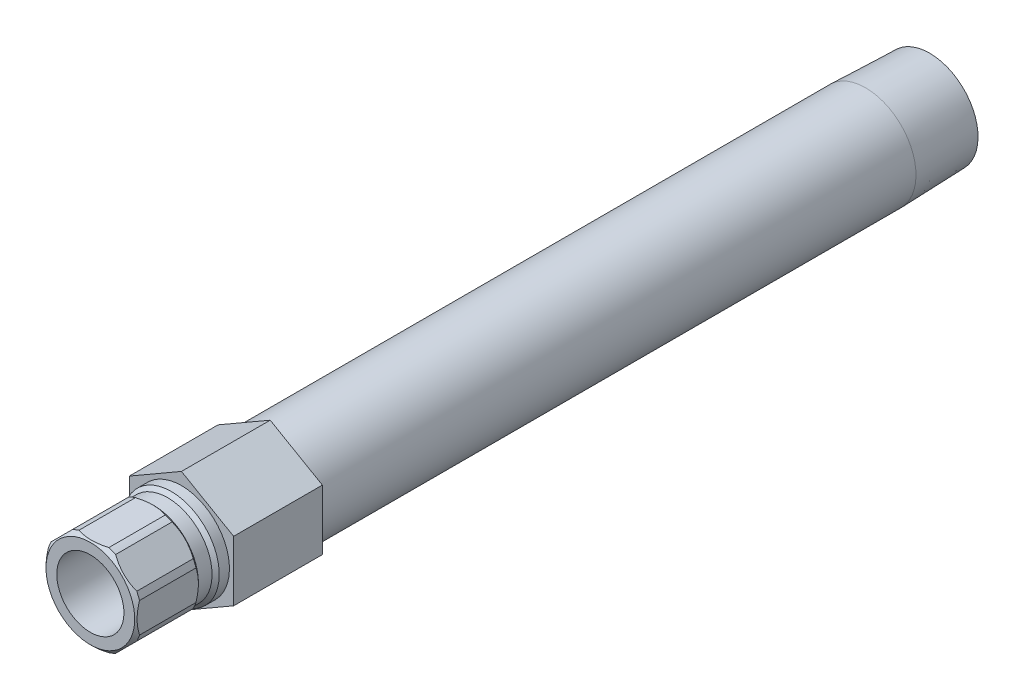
ISO-10303-21;
HEADER;
FILE_DESCRIPTION(('STEP AP214'),'2;1');
FILE_NAME('part.step','',(''),(''),'','','');
FILE_SCHEMA(('AUTOMOTIVE_DESIGN { 1 0 10303 214 1 1 1 1 }'));
ENDSEC;
DATA;
#1=APPLICATION_CONTEXT('core data for automotive mechanical design processes');
#2=APPLICATION_PROTOCOL_DEFINITION('international standard','automotive_design',2000,#1);
#3=PRODUCT_CONTEXT('',#1,'mechanical');
#4=PRODUCT('Part','Part','',(#3));
#5=PRODUCT_RELATED_PRODUCT_CATEGORY('part','',(#4));
#6=PRODUCT_DEFINITION_FORMATION('','',#4);
#7=PRODUCT_DEFINITION_CONTEXT('part definition',#1,'design');
#8=PRODUCT_DEFINITION('design','',#6,#7);
#9=PRODUCT_DEFINITION_SHAPE('','',#8);
#10=(LENGTH_UNIT() NAMED_UNIT(*) SI_UNIT(.MILLI.,.METRE.));
#11=(NAMED_UNIT(*) PLANE_ANGLE_UNIT() SI_UNIT($,.RADIAN.));
#12=(NAMED_UNIT(*) SI_UNIT($,.STERADIAN.) SOLID_ANGLE_UNIT());
#13=UNCERTAINTY_MEASURE_WITH_UNIT(LENGTH_MEASURE(1.E-05),#10,'distance_accuracy_value','');
#14=(GEOMETRIC_REPRESENTATION_CONTEXT(3) GLOBAL_UNCERTAINTY_ASSIGNED_CONTEXT((#13)) GLOBAL_UNIT_ASSIGNED_CONTEXT((#10,
#11,#12)) REPRESENTATION_CONTEXT('',''));
#15=CARTESIAN_POINT('',(0.,0.,0.));
#16=DIRECTION('',(0.,0.,1.));
#17=DIRECTION('',(1.,0.,0.));
#18=AXIS2_PLACEMENT_3D('',#15,#16,#17);
#19=CARTESIAN_POINT('',(0.,0.,0.));
#20=DIRECTION('',(0.,0.,-1.));
#21=DIRECTION('',(0.,1.,0.));
#22=AXIS2_PLACEMENT_3D('',#19,#20,#21);
#23=CYLINDRICAL_SURFACE('',#22,10.16);
#24=DIRECTION('',(0.,0.,-1.));
#25=VECTOR('',#24,1.);
#26=CARTESIAN_POINT('',(9.06826191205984,-4.58172739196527,0.));
#27=LINE('',#26,#25);
#28=CARTESIAN_POINT('',(9.06826191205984,-4.58172739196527,6.5786));
#29=VERTEX_POINT('',#28);
#30=CARTESIAN_POINT('',(9.06826191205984,-4.58172739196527,18.542));
#31=VERTEX_POINT('',#30);
#32=EDGE_CURVE('E535',#29,#31,#27,.F.);
#33=ORIENTED_EDGE('',*,*,#32,.F.);
#34=CARTESIAN_POINT('',(0.,0.,6.5786));
#35=DIRECTION('',(0.,0.,-1.));
#36=DIRECTION('',(0.,1.,0.));
#37=AXIS2_PLACEMENT_3D('',#34,#35,#36);
#38=CIRCLE('',#37,10.16);
#39=CARTESIAN_POINT('',(9.652,-3.17245898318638,6.5786));
#40=VERTEX_POINT('',#39);
#41=EDGE_CURVE('E214',#40,#29,#38,.T.);
#42=ORIENTED_EDGE('',*,*,#41,.F.);
#43=DIRECTION('',(0.,0.,-1.));
#44=VECTOR('',#43,1.);
#45=CARTESIAN_POINT('',(9.652,-3.17245898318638,0.));
#46=LINE('',#45,#44);
#47=CARTESIAN_POINT('',(9.652,-3.17245898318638,18.542));
#48=VERTEX_POINT('',#47);
#49=EDGE_CURVE('E410',#48,#40,#46,.T.);
#50=ORIENTED_EDGE('',*,*,#49,.F.);
#51=CARTESIAN_POINT('',(0.,0.,18.542));
#52=DIRECTION('',(0.,0.,-1.));
#53=DIRECTION('',(0.,1.,0.));
#54=AXIS2_PLACEMENT_3D('',#51,#52,#53);
#55=CIRCLE('',#54,10.16);
#56=EDGE_CURVE('E424',#48,#31,#55,.T.);
#57=ORIENTED_EDGE('',*,*,#56,.T.);
#58=EDGE_LOOP('',(#33,#42,#50,#57));
#59=FACE_BOUND('',#58,.T.);
#60=ADVANCED_FACE('F34',(#59),#23,.T.);
#61=DIRECTION('',(0.,0.,-1.));
#62=VECTOR('',#61,1.);
#63=CARTESIAN_POINT('',(9.652,3.17245898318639,0.));
#64=LINE('',#63,#62);
#65=CARTESIAN_POINT('',(9.652,3.1724589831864,6.57859999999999));
#66=VERTEX_POINT('',#65);
#67=CARTESIAN_POINT('',(9.652,3.17245898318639,18.542));
#68=VERTEX_POINT('',#67);
#69=EDGE_CURVE('E331',#66,#68,#64,.F.);
#70=ORIENTED_EDGE('',*,*,#69,.F.);
#71=CARTESIAN_POINT('',(9.06826191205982,4.5817273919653,6.5786));
#72=VERTEX_POINT('',#71);
#73=EDGE_CURVE('E217',#72,#66,#38,.T.);
#74=ORIENTED_EDGE('',*,*,#73,.F.);
#75=DIRECTION('',(0.,0.,-1.));
#76=VECTOR('',#75,1.);
#77=CARTESIAN_POINT('',(9.06826191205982,4.5817273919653,0.));
#78=LINE('',#77,#76);
#79=CARTESIAN_POINT('',(9.06826191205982,4.5817273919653,18.542));
#80=VERTEX_POINT('',#79);
#81=EDGE_CURVE('E403',#80,#72,#78,.T.);
#82=ORIENTED_EDGE('',*,*,#81,.F.);
#83=EDGE_CURVE('E231',#80,#68,#55,.T.);
#84=ORIENTED_EDGE('',*,*,#83,.T.);
#85=EDGE_LOOP('',(#70,#74,#82,#84));
#86=FACE_BOUND('',#85,.T.);
#87=ADVANCED_FACE('F425',(#86),#23,.T.);
#88=DIRECTION('',(0.,0.,-1.));
#89=VECTOR('',#88,1.);
#90=CARTESIAN_POINT('',(4.58172739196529,9.06826191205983,0.));
#91=LINE('',#90,#89);
#92=CARTESIAN_POINT('',(4.58172739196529,9.06826191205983,6.5786));
#93=VERTEX_POINT('',#92);
#94=CARTESIAN_POINT('',(4.58172739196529,9.06826191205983,18.542));
#95=VERTEX_POINT('',#94);
#96=EDGE_CURVE('E404',#93,#95,#91,.F.);
#97=ORIENTED_EDGE('',*,*,#96,.F.);
#98=CARTESIAN_POINT('',(3.17245898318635,9.65200000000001,6.5786));
#99=VERTEX_POINT('',#98);
#100=EDGE_CURVE('E219',#99,#93,#38,.T.);
#101=ORIENTED_EDGE('',*,*,#100,.F.);
#102=DIRECTION('',(0.,0.,-1.));
#103=VECTOR('',#102,1.);
#104=CARTESIAN_POINT('',(3.17245898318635,9.65200000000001,0.));
#105=LINE('',#104,#103);
#106=CARTESIAN_POINT('',(3.17245898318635,9.65200000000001,18.542));
#107=VERTEX_POINT('',#106);
#108=EDGE_CURVE('E397',#107,#99,#105,.T.);
#109=ORIENTED_EDGE('',*,*,#108,.F.);
#110=EDGE_CURVE('E227',#107,#95,#55,.T.);
#111=ORIENTED_EDGE('',*,*,#110,.T.);
#112=EDGE_LOOP('',(#97,#101,#109,#111));
#113=FACE_BOUND('',#112,.T.);
#114=ADVANCED_FACE('F444',(#113),#23,.T.);
#115=DIRECTION('',(0.,0.,-1.));
#116=VECTOR('',#115,1.);
#117=CARTESIAN_POINT('',(-3.17245898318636,9.65200000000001,0.));
#118=LINE('',#117,#116);
#119=CARTESIAN_POINT('',(-3.17245898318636,9.65200000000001,6.5786));
#120=VERTEX_POINT('',#119);
#121=CARTESIAN_POINT('',(-3.17245898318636,9.65200000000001,18.542));
#122=VERTEX_POINT('',#121);
#123=EDGE_CURVE('E398',#120,#122,#118,.F.);
#124=ORIENTED_EDGE('',*,*,#123,.F.);
#125=CARTESIAN_POINT('',(-4.5817273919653,9.06826191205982,6.5786));
#126=VERTEX_POINT('',#125);
#127=EDGE_CURVE('E224',#126,#120,#38,.T.);
#128=ORIENTED_EDGE('',*,*,#127,.F.);
#129=DIRECTION('',(0.,0.,-1.));
#130=VECTOR('',#129,1.);
#131=CARTESIAN_POINT('',(-4.5817273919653,9.06826191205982,0.));
#132=LINE('',#131,#130);
#133=CARTESIAN_POINT('',(-4.5817273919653,9.06826191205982,18.542));
#134=VERTEX_POINT('',#133);
#135=EDGE_CURVE('E54',#134,#126,#132,.T.);
#136=ORIENTED_EDGE('',*,*,#135,.F.);
#137=EDGE_CURVE('E223',#134,#122,#55,.T.);
#138=ORIENTED_EDGE('',*,*,#137,.T.);
#139=EDGE_LOOP('',(#124,#128,#136,#138));
#140=FACE_BOUND('',#139,.T.);
#141=ADVANCED_FACE('F439',(#140),#23,.T.);
#142=DIRECTION('',(0.,0.,-1.));
#143=VECTOR('',#142,1.);
#144=CARTESIAN_POINT('',(-9.06826191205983,4.58172739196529,0.));
#145=LINE('',#144,#143);
#146=CARTESIAN_POINT('',(-9.06826191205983,4.58172739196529,6.5786));
#147=VERTEX_POINT('',#146);
#148=CARTESIAN_POINT('',(-9.06826191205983,4.58172739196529,18.542));
#149=VERTEX_POINT('',#148);
#150=EDGE_CURVE('E394',#147,#149,#145,.F.);
#151=ORIENTED_EDGE('',*,*,#150,.F.);
#152=CARTESIAN_POINT('',(-9.652,3.17245898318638,6.5786));
#153=VERTEX_POINT('',#152);
#154=EDGE_CURVE('E447',#153,#147,#38,.T.);
#155=ORIENTED_EDGE('',*,*,#154,.F.);
#156=DIRECTION('',(0.,0.,-1.));
#157=VECTOR('',#156,1.);
#158=CARTESIAN_POINT('',(-9.652,3.17245898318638,0.));
#159=LINE('',#158,#157);
#160=CARTESIAN_POINT('',(-9.652,3.17245898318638,18.542));
#161=VERTEX_POINT('',#160);
#162=EDGE_CURVE('E62',#161,#153,#159,.T.);
#163=ORIENTED_EDGE('',*,*,#162,.F.);
#164=EDGE_CURVE('E430',#161,#149,#55,.T.);
#165=ORIENTED_EDGE('',*,*,#164,.T.);
#166=EDGE_LOOP('',(#151,#155,#163,#165));
#167=FACE_BOUND('',#166,.T.);
#168=ADVANCED_FACE('F554',(#167),#23,.T.);
#169=DIRECTION('',(0.,0.,-1.));
#170=VECTOR('',#169,1.);
#171=CARTESIAN_POINT('',(-9.652,-3.17245898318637,0.));
#172=LINE('',#171,#170);
#173=CARTESIAN_POINT('',(-9.652,-3.17245898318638,6.5786));
#174=VERTEX_POINT('',#173);
#175=CARTESIAN_POINT('',(-9.652,-3.17245898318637,18.542));
#176=VERTEX_POINT('',#175);
#177=EDGE_CURVE('E392',#174,#176,#172,.F.);
#178=ORIENTED_EDGE('',*,*,#177,.F.);
#179=CARTESIAN_POINT('',(-9.06826191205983,-4.58172739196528,6.5786));
#180=VERTEX_POINT('',#179);
#181=EDGE_CURVE('E218',#180,#174,#38,.T.);
#182=ORIENTED_EDGE('',*,*,#181,.F.);
#183=DIRECTION('',(0.,0.,-1.));
#184=VECTOR('',#183,1.);
#185=CARTESIAN_POINT('',(-9.06826191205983,-4.58172739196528,0.));
#186=LINE('',#185,#184);
#187=CARTESIAN_POINT('',(-9.06826191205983,-4.58172739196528,18.542));
#188=VERTEX_POINT('',#187);
#189=EDGE_CURVE('E269',#188,#180,#186,.T.);
#190=ORIENTED_EDGE('',*,*,#189,.F.);
#191=EDGE_CURVE('E428',#188,#176,#55,.T.);
#192=ORIENTED_EDGE('',*,*,#191,.T.);
#193=EDGE_LOOP('',(#178,#182,#190,#192));
#194=FACE_BOUND('',#193,.T.);
#195=ADVANCED_FACE('F548',(#194),#23,.T.);
#196=DIRECTION('',(0.,0.,-1.));
#197=VECTOR('',#196,1.);
#198=CARTESIAN_POINT('',(-4.58172739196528,-9.06826191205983,0.));
#199=LINE('',#198,#197);
#200=CARTESIAN_POINT('',(-4.58172739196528,-9.06826191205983,6.5786));
#201=VERTEX_POINT('',#200);
#202=CARTESIAN_POINT('',(-4.58172739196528,-9.06826191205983,18.542));
#203=VERTEX_POINT('',#202);
#204=EDGE_CURVE('E382',#201,#203,#199,.F.);
#205=ORIENTED_EDGE('',*,*,#204,.F.);
#206=CARTESIAN_POINT('',(-3.17245898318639,-9.65199999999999,6.5786));
#207=VERTEX_POINT('',#206);
#208=EDGE_CURVE('E215',#207,#201,#38,.T.);
#209=ORIENTED_EDGE('',*,*,#208,.F.);
#210=DIRECTION('',(0.,0.,-1.));
#211=VECTOR('',#210,1.);
#212=CARTESIAN_POINT('',(-3.17245898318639,-9.65199999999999,0.));
#213=LINE('',#212,#211);
#214=CARTESIAN_POINT('',(-3.17245898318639,-9.65199999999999,18.542));
#215=VERTEX_POINT('',#214);
#216=EDGE_CURVE('E192',#215,#207,#213,.T.);
#217=ORIENTED_EDGE('',*,*,#216,.F.);
#218=EDGE_CURVE('E391',#215,#203,#55,.T.);
#219=ORIENTED_EDGE('',*,*,#218,.T.);
#220=EDGE_LOOP('',(#205,#209,#217,#219));
#221=FACE_BOUND('',#220,.T.);
#222=ADVANCED_FACE('F389',(#221),#23,.T.);
#223=CARTESIAN_POINT('',(0.,0.,0.));
#224=DIRECTION('',(0.,0.,-1.));
#225=DIRECTION('',(0.,1.,0.));
#226=AXIS2_PLACEMENT_3D('',#223,#224,#225);
#227=CYLINDRICAL_SURFACE('',#226,7.112);
#228=CARTESIAN_POINT('',(0.,0.,1.524));
#229=DIRECTION('',(0.,0.,-1.));
#230=DIRECTION('',(0.,1.,0.));
#231=AXIS2_PLACEMENT_3D('',#228,#229,#230);
#232=CIRCLE('',#231,7.112);
#233=CARTESIAN_POINT('',(0.,7.112,1.524));
#234=VERTEX_POINT('',#233);
#235=EDGE_CURVE('E474',#234,#234,#232,.T.);
#236=ORIENTED_EDGE('',*,*,#235,.T.);
#237=EDGE_LOOP('',(#236));
#238=FACE_BOUND('',#237,.T.);
#239=CARTESIAN_POINT('',(0.,0.,19.304));
#240=DIRECTION('',(0.,0.,-1.));
#241=DIRECTION('',(0.,1.,0.));
#242=AXIS2_PLACEMENT_3D('',#239,#240,#241);
#243=CIRCLE('',#242,7.112);
#244=CARTESIAN_POINT('',(0.,7.112,19.304));
#245=VERTEX_POINT('',#244);
#246=EDGE_CURVE('E234',#245,#245,#243,.T.);
#247=ORIENTED_EDGE('',*,*,#246,.F.);
#248=EDGE_LOOP('',(#247));
#249=FACE_BOUND('',#248,.T.);
#250=ADVANCED_FACE('F36',(#238,#249),#227,.F.);
#251=CARTESIAN_POINT('',(0.,7.112,19.304));
#252=DIRECTION('',(0.,0.,1.));
#253=DIRECTION('',(0.,-1.,0.));
#254=AXIS2_PLACEMENT_3D('',#251,#252,#253);
#255=PLANE('',#254);
#256=ORIENTED_EDGE('',*,*,#246,.T.);
#257=EDGE_LOOP('',(#256));
#258=FACE_BOUND('',#257,.T.);
#259=CARTESIAN_POINT('',(0.,0.,19.304));
#260=DIRECTION('',(0.,0.,-1.));
#261=DIRECTION('',(0.,1.,0.));
#262=AXIS2_PLACEMENT_3D('',#259,#260,#261);
#263=CIRCLE('',#262,9.398);
#264=CARTESIAN_POINT('',(0.,9.398,19.304));
#265=VERTEX_POINT('',#264);
#266=EDGE_CURVE('E230',#265,#265,#263,.T.);
#267=ORIENTED_EDGE('',*,*,#266,.F.);
#268=EDGE_LOOP('',(#267));
#269=FACE_BOUND('',#268,.T.);
#270=ADVANCED_FACE('F275',(#258,#269),#255,.T.);
#271=CARTESIAN_POINT('',(0.,0.,18.542));
#272=DIRECTION('',(0.,0.,-1.));
#273=DIRECTION('',(0.,1.,0.));
#274=AXIS2_PLACEMENT_3D('',#271,#272,#273);
#275=CONICAL_SURFACE('',#274,10.16,0.785398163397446);
#276=CARTESIAN_POINT('',(9.06871478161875,-4.58127452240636,18.5418));
#277=CARTESIAN_POINT('',(8.8974665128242,-4.7525227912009,18.6174888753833));
#278=CARTESIAN_POINT('',(8.72454398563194,-4.92544531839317,18.6860001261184));
#279=CARTESIAN_POINT('',(8.37571487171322,-5.27427443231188,18.8068689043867));
#280=CARTESIAN_POINT('',(8.1998052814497,-5.4501840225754,18.85920901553));
#281=CARTESIAN_POINT('',(7.84982827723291,-5.80016102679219,18.9447662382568));
#282=CARTESIAN_POINT('',(7.67581225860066,-5.97417704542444,18.9783973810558));
#283=CARTESIAN_POINT('',(7.32656572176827,-6.32342358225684,19.0270891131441));
#284=CARTESIAN_POINT('',(7.1513358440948,-6.4986534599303,19.0421588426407));
#285=CARTESIAN_POINT('',(6.77605057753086,-6.87393872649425,19.0538859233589));
#286=CARTESIAN_POINT('',(6.57594647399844,-7.07404283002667,19.0476773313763));
#287=CARTESIAN_POINT('',(6.17675989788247,-7.47322940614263,19.0106603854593));
#288=CARTESIAN_POINT('',(5.97767829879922,-7.67231100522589,18.9798336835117));
#289=CARTESIAN_POINT('',(5.57666706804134,-8.07332223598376,18.8939894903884));
#290=CARTESIAN_POINT('',(5.37480504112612,-8.27518426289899,18.8383431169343));
#291=CARTESIAN_POINT('',(5.07491153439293,-8.57507776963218,18.7386783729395));
#292=CARTESIAN_POINT('',(4.97548345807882,-8.67450584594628,18.7027814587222));
#293=CARTESIAN_POINT('',(4.77762502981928,-8.87236427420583,18.6259657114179));
#294=CARTESIAN_POINT('',(4.67919445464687,-8.97079484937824,18.5850480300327));
#295=CARTESIAN_POINT('',(4.58127452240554,-9.06871478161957,18.5417999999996));
#296=B_SPLINE_CURVE_WITH_KNOTS('',3,(#276,#277,#278,#279,#280,#281,#282,#283,#284,#285,#286,
#287,#288,#289,#290,#291,#292,#293,#294,#295),.UNSPECIFIED.,.F.,.F.,(4,2,2,2,2,2,2,2,2,4),(0.,
0.761268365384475,1.52335378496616,2.26782503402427,3.01192953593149,3.85997332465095,
4.70864975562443,5.5801727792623,6.01546212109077,6.45065179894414),.UNSPECIFIED.);
#297=CARTESIAN_POINT('',(4.58172739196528,-9.06826191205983,18.542));
#298=VERTEX_POINT('',#297);
#299=EDGE_CURVE('E530',#31,#298,#296,.T.);
#300=ORIENTED_EDGE('',*,*,#299,.F.);
#301=ORIENTED_EDGE('',*,*,#56,.F.);
#302=CARTESIAN_POINT('',(9.652,-7.71050187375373,16.3483388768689));
#303=CARTESIAN_POINT('',(9.652,-7.52475481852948,16.4642553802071));
#304=CARTESIAN_POINT('',(9.652,-7.33786285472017,16.5783624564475));
#305=CARTESIAN_POINT('',(9.652,-6.96152272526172,16.8023812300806));
#306=CARTESIAN_POINT('',(9.652,-6.77207395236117,16.9122919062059));
#307=CARTESIAN_POINT('',(9.652,-6.38961701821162,17.1277502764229));
#308=CARTESIAN_POINT('',(9.652,-6.19659699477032,17.2332770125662));
#309=CARTESIAN_POINT('',(9.652,-5.8076024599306,17.4386922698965));
#310=CARTESIAN_POINT('',(9.652,-5.61162813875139,17.5385811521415));
#311=CARTESIAN_POINT('',(9.652,-5.01021259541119,17.8328232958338));
#312=CARTESIAN_POINT('',(9.652,-4.59965798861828,18.0169416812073));
#313=CARTESIAN_POINT('',(9.652,-3.76461195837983,18.3488686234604));
#314=CARTESIAN_POINT('',(9.652,-3.34014745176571,18.4967430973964));
#315=CARTESIAN_POINT('',(9.652,-2.66836152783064,18.6905975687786));
#316=CARTESIAN_POINT('',(9.652,-2.42567962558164,18.7527238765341));
#317=CARTESIAN_POINT('',(9.652,-1.93662453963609,18.860517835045));
#318=CARTESIAN_POINT('',(9.652,-1.69025117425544,18.9061846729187));
#319=CARTESIAN_POINT('',(9.652,-1.1971622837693,18.9790662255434));
#320=CARTESIAN_POINT('',(9.652,-0.950472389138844,19.0064526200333));
#321=CARTESIAN_POINT('',(9.652,-0.455710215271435,19.0423990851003));
#322=CARTESIAN_POINT('',(9.652,-0.207637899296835,19.0509586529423));
#323=CARTESIAN_POINT('',(9.652,0.333683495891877,19.048681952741));
#324=CARTESIAN_POINT('',(9.652,0.626923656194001,19.0340251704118));
#325=CARTESIAN_POINT('',(9.652,1.21094277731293,18.9786837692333));
#326=CARTESIAN_POINT('',(9.652,1.50172122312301,18.9379938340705));
#327=CARTESIAN_POINT('',(9.652,2.08266136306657,18.8320509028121));
#328=CARTESIAN_POINT('',(9.652,2.37276468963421,18.7664820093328));
#329=CARTESIAN_POINT('',(9.652,2.94714147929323,18.6138865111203));
#330=CARTESIAN_POINT('',(9.652,3.2314158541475,18.5268632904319));
#331=CARTESIAN_POINT('',(9.652,3.82869981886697,18.3226103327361));
#332=CARTESIAN_POINT('',(9.652,4.14087760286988,18.2029681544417));
#333=CARTESIAN_POINT('',(9.652,4.75742701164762,17.9448741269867));
#334=CARTESIAN_POINT('',(9.652,5.06179505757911,17.8064138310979));
#335=CARTESIAN_POINT('',(9.652,5.66409479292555,17.5139015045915));
#336=CARTESIAN_POINT('',(9.652,5.9620026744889,17.3598008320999));
#337=CARTESIAN_POINT('',(9.652,6.55107386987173,17.0393844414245));
#338=CARTESIAN_POINT('',(9.652,6.84223818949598,16.8730705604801));
#339=CARTESIAN_POINT('',(9.652,7.40668231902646,16.5376791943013));
#340=CARTESIAN_POINT('',(9.652,7.68020242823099,16.3690040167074));
#341=CARTESIAN_POINT('',(9.652,8.22250898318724,16.0241853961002));
#342=CARTESIAN_POINT('',(9.652,8.49129505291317,15.848041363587));
#343=CARTESIAN_POINT('',(9.652,9.02258177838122,15.4910339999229));
#344=CARTESIAN_POINT('',(9.652,9.28511552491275,15.3102197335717));
#345=CARTESIAN_POINT('',(9.652,9.80652727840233,14.9435456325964));
#346=CARTESIAN_POINT('',(9.652,10.0654063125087,14.7576872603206));
#347=CARTESIAN_POINT('',(9.652,10.3227473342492,14.5697596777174));
#348=B_SPLINE_CURVE_WITH_KNOTS('',3,(#302,#303,#304,#305,#306,#307,#308,#309,#310,#311,#312,
#313,#314,#315,#316,#317,#318,#319,#320,#321,#322,#323,#324,#325,#326,#327,#328,#329,#330,#331,
#332,#333,#334,#335,#336,#337,#338,#339,#340,#341,#342,#343,#344,#345,#346,#347),.UNSPECIFIED.,
.F.,.F.,(4,2,2,2,2,2,2,2,2,2,2,2,2,2,2,2,2,2,2,2,2,2,4),(0.,0.656855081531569,1.31386901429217,
1.97372850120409,2.63354568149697,3.98211483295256,5.32821282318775,6.07925616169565,
6.83033658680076,7.5742601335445,8.31820354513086,9.1977741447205,10.0775244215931,
10.9688407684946,11.8600166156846,12.8622077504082,13.8648502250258,14.8707124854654,
15.8764237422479,16.8403261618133,17.8043048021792,18.7605668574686,19.7165545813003),.UNSPECIFIED.);
#349=EDGE_CURVE('E323',#68,#48,#348,.F.);
#350=ORIENTED_EDGE('',*,*,#349,.F.);
#351=ORIENTED_EDGE('',*,*,#83,.F.);
#352=CARTESIAN_POINT('',(4.58127452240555,9.06871478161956,18.5417999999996));
#353=CARTESIAN_POINT('',(4.75252279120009,8.89746651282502,18.617488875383));
#354=CARTESIAN_POINT('',(4.92544531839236,8.72454398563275,18.6860001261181));
#355=CARTESIAN_POINT('',(5.27427443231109,8.37571487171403,18.8068689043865));
#356=CARTESIAN_POINT('',(5.45018402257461,8.19980528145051,18.8592090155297));
#357=CARTESIAN_POINT('',(5.8001610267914,7.84982827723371,18.9447662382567));
#358=CARTESIAN_POINT('',(5.97417704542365,7.67581225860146,18.9783973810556));
#359=CARTESIAN_POINT('',(6.32342358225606,7.32656572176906,19.027089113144));
#360=CARTESIAN_POINT('',(6.49865345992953,7.15133584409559,19.0421588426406));
#361=CARTESIAN_POINT('',(6.87393872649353,6.77605057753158,19.0538859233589));
#362=CARTESIAN_POINT('',(7.07404283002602,6.5759464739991,19.0476773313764));
#363=CARTESIAN_POINT('',(7.47322940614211,6.17675989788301,19.0106603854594));
#364=CARTESIAN_POINT('',(7.67231100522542,5.97767829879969,18.9798336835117));
#365=CARTESIAN_POINT('',(8.07332223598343,5.57666706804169,18.8939894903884));
#366=CARTESIAN_POINT('',(8.27518426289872,5.37480504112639,18.8383431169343));
#367=CARTESIAN_POINT('',(8.57507776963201,5.07491153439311,18.7386783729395));
#368=CARTESIAN_POINT('',(8.67450584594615,4.97548345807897,18.7027814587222));
#369=CARTESIAN_POINT('',(8.87236427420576,4.77762502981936,18.6259657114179));
#370=CARTESIAN_POINT('',(8.9707948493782,4.67919445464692,18.5850480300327));
#371=CARTESIAN_POINT('',(9.06871478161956,4.58127452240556,18.5417999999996));
#372=B_SPLINE_CURVE_WITH_KNOTS('',3,(#352,#353,#354,#355,#356,#357,#358,#359,#360,#361,#362,
#363,#364,#365,#366,#367,#368,#369,#370,#371),.UNSPECIFIED.,.F.,.F.,(4,2,2,2,2,2,2,2,2,4),(0.,
0.761268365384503,1.52335378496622,2.26782503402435,3.01192953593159,3.85997332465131,
4.70864975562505,5.5801727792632,6.01546212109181,6.45065179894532),.UNSPECIFIED.);
#373=EDGE_CURVE('E315',#95,#80,#372,.T.);
#374=ORIENTED_EDGE('',*,*,#373,.F.);
#375=ORIENTED_EDGE('',*,*,#110,.F.);
#376=CARTESIAN_POINT('',(-7.71050187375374,9.65200000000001,16.3483388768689));
#377=CARTESIAN_POINT('',(-7.52475481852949,9.65200000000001,16.4642553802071));
#378=CARTESIAN_POINT('',(-7.33786285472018,9.65200000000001,16.5783624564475));
#379=CARTESIAN_POINT('',(-6.96152272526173,9.65200000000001,16.8023812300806));
#380=CARTESIAN_POINT('',(-6.77207395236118,9.65200000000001,16.9122919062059));
#381=CARTESIAN_POINT('',(-6.38961701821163,9.65200000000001,17.1277502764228));
#382=CARTESIAN_POINT('',(-6.19659699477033,9.65200000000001,17.2332770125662));
#383=CARTESIAN_POINT('',(-5.8076024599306,9.65200000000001,17.4386922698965));
#384=CARTESIAN_POINT('',(-5.6116281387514,9.65200000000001,17.5385811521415));
#385=CARTESIAN_POINT('',(-5.01021259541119,9.65200000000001,17.8328232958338));
#386=CARTESIAN_POINT('',(-4.59965798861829,9.65200000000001,18.0169416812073));
#387=CARTESIAN_POINT('',(-3.76461195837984,9.65200000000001,18.3488686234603));
#388=CARTESIAN_POINT('',(-3.34014745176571,9.65200000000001,18.4967430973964));
#389=CARTESIAN_POINT('',(-2.66836152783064,9.65200000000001,18.6905975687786));
#390=CARTESIAN_POINT('',(-2.42567962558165,9.65200000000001,18.7527238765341));
#391=CARTESIAN_POINT('',(-1.9366245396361,9.65200000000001,18.860517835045));
#392=CARTESIAN_POINT('',(-1.69025117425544,9.65200000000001,18.9061846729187));
#393=CARTESIAN_POINT('',(-1.1971622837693,9.65200000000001,18.9790662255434));
#394=CARTESIAN_POINT('',(-0.950472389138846,9.65200000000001,19.0064526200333));
#395=CARTESIAN_POINT('',(-0.455710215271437,9.65200000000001,19.0423990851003));
#396=CARTESIAN_POINT('',(-0.207637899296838,9.65200000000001,19.0509586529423));
#397=CARTESIAN_POINT('',(0.333683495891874,9.65200000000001,19.0486819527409));
#398=CARTESIAN_POINT('',(0.626923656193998,9.65200000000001,19.0340251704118));
#399=CARTESIAN_POINT('',(1.21094277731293,9.65200000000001,18.9786837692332));
#400=CARTESIAN_POINT('',(1.501721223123,9.65200000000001,18.9379938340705));
#401=CARTESIAN_POINT('',(2.08266136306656,9.65200000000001,18.832050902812));
#402=CARTESIAN_POINT('',(2.3727646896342,9.65200000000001,18.7664820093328));
#403=CARTESIAN_POINT('',(2.94714147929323,9.65200000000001,18.6138865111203));
#404=CARTESIAN_POINT('',(3.23141585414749,9.65200000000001,18.5268632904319));
#405=CARTESIAN_POINT('',(3.82869981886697,9.65200000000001,18.3226103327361));
#406=CARTESIAN_POINT('',(4.14087760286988,9.65200000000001,18.2029681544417));
#407=CARTESIAN_POINT('',(4.75742701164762,9.65200000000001,17.9448741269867));
#408=CARTESIAN_POINT('',(5.0617950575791,9.65200000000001,17.8064138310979));
#409=CARTESIAN_POINT('',(5.66409479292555,9.65200000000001,17.5139015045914));
#410=CARTESIAN_POINT('',(5.9620026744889,9.65200000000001,17.3598008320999));
#411=CARTESIAN_POINT('',(6.55107386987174,9.65200000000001,17.0393844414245));
#412=CARTESIAN_POINT('',(6.84223818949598,9.65200000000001,16.8730705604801));
#413=CARTESIAN_POINT('',(7.40668231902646,9.65200000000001,16.5376791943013));
#414=CARTESIAN_POINT('',(7.680202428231,9.65200000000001,16.3690040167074));
#415=CARTESIAN_POINT('',(8.22250898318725,9.65200000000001,16.0241853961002));
#416=CARTESIAN_POINT('',(8.49129505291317,9.65200000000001,15.8480413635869));
#417=CARTESIAN_POINT('',(9.02258177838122,9.65200000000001,15.4910339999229));
#418=CARTESIAN_POINT('',(9.28511552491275,9.65200000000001,15.3102197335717));
#419=CARTESIAN_POINT('',(9.80652727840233,9.65200000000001,14.9435456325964));
#420=CARTESIAN_POINT('',(10.0654063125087,9.65200000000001,14.7576872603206));
#421=CARTESIAN_POINT('',(10.3227473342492,9.65200000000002,14.5697596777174));
#422=B_SPLINE_CURVE_WITH_KNOTS('',3,(#376,#377,#378,#379,#380,#381,#382,#383,#384,#385,#386,
#387,#388,#389,#390,#391,#392,#393,#394,#395,#396,#397,#398,#399,#400,#401,#402,#403,#404,#405,
#406,#407,#408,#409,#410,#411,#412,#413,#414,#415,#416,#417,#418,#419,#420,#421),.UNSPECIFIED.,
.F.,.F.,(4,2,2,2,2,2,2,2,2,2,2,2,2,2,2,2,2,2,2,2,2,2,4),(0.,0.656855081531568,1.31386901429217,
1.97372850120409,2.63354568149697,3.98211483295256,5.32821282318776,6.07925616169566,
6.83033658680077,7.57426013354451,8.31820354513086,9.1977741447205,10.0775244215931,
10.9688407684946,11.8600166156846,12.8622077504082,13.8648502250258,14.8707124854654,
15.8764237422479,16.8403261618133,17.8043048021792,18.7605668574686,19.7165545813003),.UNSPECIFIED.);
#423=EDGE_CURVE('E307',#122,#107,#422,.T.);
#424=ORIENTED_EDGE('',*,*,#423,.F.);
#425=ORIENTED_EDGE('',*,*,#137,.F.);
#426=CARTESIAN_POINT('',(-9.06871478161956,4.58127452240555,18.5417999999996));
#427=CARTESIAN_POINT('',(-8.89746651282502,4.7525227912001,18.617488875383));
#428=CARTESIAN_POINT('',(-8.72454398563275,4.92544531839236,18.6860001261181));
#429=CARTESIAN_POINT('',(-8.37571487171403,5.27427443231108,18.8068689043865));
#430=CARTESIAN_POINT('',(-8.19980528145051,5.45018402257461,18.8592090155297));
#431=CARTESIAN_POINT('',(-7.84982827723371,5.8001610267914,18.9447662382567));
#432=CARTESIAN_POINT('',(-7.67581225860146,5.97417704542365,18.9783973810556));
#433=CARTESIAN_POINT('',(-7.32656572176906,6.32342358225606,19.027089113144));
#434=CARTESIAN_POINT('',(-7.15133584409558,6.49865345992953,19.0421588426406));
#435=CARTESIAN_POINT('',(-6.77605057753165,6.87393872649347,19.0538859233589));
#436=CARTESIAN_POINT('',(-6.57594647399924,7.07404283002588,19.0476773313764));
#437=CARTESIAN_POINT('',(-6.17675989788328,7.47322940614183,19.0106603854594));
#438=CARTESIAN_POINT('',(-5.97767829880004,7.67231100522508,18.9798336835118));
#439=CARTESIAN_POINT('',(-5.57666706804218,8.07332223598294,18.8939894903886));
#440=CARTESIAN_POINT('',(-5.37480504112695,8.27518426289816,18.8383431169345));
#441=CARTESIAN_POINT('',(-5.07491153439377,8.57507776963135,18.7386783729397));
#442=CARTESIAN_POINT('',(-4.97548345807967,8.67450584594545,18.7027814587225));
#443=CARTESIAN_POINT('',(-4.77762502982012,8.87236427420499,18.6259657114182));
#444=CARTESIAN_POINT('',(-4.67919445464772,8.9707948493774,18.585048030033));
#445=CARTESIAN_POINT('',(-4.58127452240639,9.06871478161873,18.5418));
#446=B_SPLINE_CURVE_WITH_KNOTS('',3,(#426,#427,#428,#429,#430,#431,#432,#433,#434,#435,#436,
#437,#438,#439,#440,#441,#442,#443,#444,#445),.UNSPECIFIED.,.F.,.F.,(4,2,2,2,2,2,2,2,2,4),(0.,
0.7612683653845,1.52335378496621,2.26782503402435,3.01192953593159,3.85997332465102,
4.70864975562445,5.58017277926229,6.01546212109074,6.45065179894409),.UNSPECIFIED.);
#447=EDGE_CURVE('E298',#149,#134,#446,.T.);
#448=ORIENTED_EDGE('',*,*,#447,.F.);
#449=ORIENTED_EDGE('',*,*,#164,.F.);
#450=CARTESIAN_POINT('',(-9.652,-7.71050187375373,16.3483388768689));
#451=CARTESIAN_POINT('',(-9.652,-7.52475481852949,16.4642553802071));
#452=CARTESIAN_POINT('',(-9.652,-7.33786285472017,16.5783624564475));
#453=CARTESIAN_POINT('',(-9.652,-6.96152272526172,16.8023812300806));
#454=CARTESIAN_POINT('',(-9.652,-6.77207395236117,16.9122919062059));
#455=CARTESIAN_POINT('',(-9.652,-6.38961701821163,17.1277502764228));
#456=CARTESIAN_POINT('',(-9.652,-6.19659699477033,17.2332770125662));
#457=CARTESIAN_POINT('',(-9.652,-5.8076024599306,17.4386922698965));
#458=CARTESIAN_POINT('',(-9.652,-5.6116281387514,17.5385811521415));
#459=CARTESIAN_POINT('',(-9.652,-5.01021259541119,17.8328232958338));
#460=CARTESIAN_POINT('',(-9.652,-4.59965798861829,18.0169416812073));
#461=CARTESIAN_POINT('',(-9.652,-3.76461195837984,18.3488686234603));
#462=CARTESIAN_POINT('',(-9.652,-3.34014745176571,18.4967430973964));
#463=CARTESIAN_POINT('',(-9.652,-2.66836152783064,18.6905975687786));
#464=CARTESIAN_POINT('',(-9.652,-2.42567962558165,18.7527238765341));
#465=CARTESIAN_POINT('',(-9.652,-1.9366245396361,18.860517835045));
#466=CARTESIAN_POINT('',(-9.652,-1.69025117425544,18.9061846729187));
#467=CARTESIAN_POINT('',(-9.652,-1.1971622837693,18.9790662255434));
#468=CARTESIAN_POINT('',(-9.652,-0.950472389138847,19.0064526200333));
#469=CARTESIAN_POINT('',(-9.652,-0.455710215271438,19.0423990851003));
#470=CARTESIAN_POINT('',(-9.652,-0.207637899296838,19.0509586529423));
#471=CARTESIAN_POINT('',(-9.652,0.333683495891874,19.0486819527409));
#472=CARTESIAN_POINT('',(-9.652,0.626923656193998,19.0340251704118));
#473=CARTESIAN_POINT('',(-9.652,1.21094277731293,18.9786837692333));
#474=CARTESIAN_POINT('',(-9.652,1.501721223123,18.9379938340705));
#475=CARTESIAN_POINT('',(-9.652,2.08266136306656,18.8320509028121));
#476=CARTESIAN_POINT('',(-9.652,2.3727646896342,18.7664820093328));
#477=CARTESIAN_POINT('',(-9.652,2.94714147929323,18.6138865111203));
#478=CARTESIAN_POINT('',(-9.652,3.2314158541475,18.5268632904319));
#479=CARTESIAN_POINT('',(-9.652,3.82869981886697,18.3226103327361));
#480=CARTESIAN_POINT('',(-9.652,4.14087760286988,18.2029681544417));
#481=CARTESIAN_POINT('',(-9.652,4.75742701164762,17.9448741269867));
#482=CARTESIAN_POINT('',(-9.652,5.06179505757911,17.8064138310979));
#483=CARTESIAN_POINT('',(-9.652,5.66409479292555,17.5139015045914));
#484=CARTESIAN_POINT('',(-9.652,5.9620026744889,17.3598008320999));
#485=CARTESIAN_POINT('',(-9.652,6.55107386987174,17.0393844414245));
#486=CARTESIAN_POINT('',(-9.652,6.84223818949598,16.8730705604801));
#487=CARTESIAN_POINT('',(-9.652,7.40668231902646,16.5376791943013));
#488=CARTESIAN_POINT('',(-9.652,7.68020242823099,16.3690040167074));
#489=CARTESIAN_POINT('',(-9.652,8.22250898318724,16.0241853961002));
#490=CARTESIAN_POINT('',(-9.652,8.49129505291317,15.848041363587));
#491=CARTESIAN_POINT('',(-9.652,9.02258177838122,15.4910339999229));
#492=CARTESIAN_POINT('',(-9.652,9.28511552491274,15.3102197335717));
#493=CARTESIAN_POINT('',(-9.652,9.80652727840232,14.9435456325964));
#494=CARTESIAN_POINT('',(-9.652,10.0654063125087,14.7576872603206));
#495=CARTESIAN_POINT('',(-9.652,10.3227473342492,14.5697596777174));
#496=B_SPLINE_CURVE_WITH_KNOTS('',3,(#450,#451,#452,#453,#454,#455,#456,#457,#458,#459,#460,
#461,#462,#463,#464,#465,#466,#467,#468,#469,#470,#471,#472,#473,#474,#475,#476,#477,#478,#479,
#480,#481,#482,#483,#484,#485,#486,#487,#488,#489,#490,#491,#492,#493,#494,#495),.UNSPECIFIED.,
.F.,.F.,(4,2,2,2,2,2,2,2,2,2,2,2,2,2,2,2,2,2,2,2,2,2,4),(0.,0.656855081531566,1.31386901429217,
1.97372850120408,2.63354568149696,3.98211483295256,5.32821282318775,6.07925616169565,
6.83033658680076,7.5742601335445,8.31820354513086,9.19777414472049,10.0775244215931,
10.9688407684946,11.8600166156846,12.8622077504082,13.8648502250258,14.8707124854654,
15.8764237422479,16.8403261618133,17.8043048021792,18.7605668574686,19.7165545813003),.UNSPECIFIED.);
#497=EDGE_CURVE('E290',#176,#161,#496,.T.);
#498=ORIENTED_EDGE('',*,*,#497,.F.);
#499=ORIENTED_EDGE('',*,*,#191,.F.);
#500=CARTESIAN_POINT('',(-4.58127452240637,-9.06871478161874,18.5418));
#501=CARTESIAN_POINT('',(-4.75252279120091,-8.8974665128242,18.6174888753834));
#502=CARTESIAN_POINT('',(-4.92544531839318,-8.72454398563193,18.6860001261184));
#503=CARTESIAN_POINT('',(-5.27427443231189,-8.37571487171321,18.8068689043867));
#504=CARTESIAN_POINT('',(-5.45018402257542,-8.19980528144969,18.85920901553));
#505=CARTESIAN_POINT('',(-5.8001610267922,-7.8498282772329,18.9447662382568));
#506=CARTESIAN_POINT('',(-5.97417704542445,-7.67581225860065,18.9783973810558));
#507=CARTESIAN_POINT('',(-6.32342358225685,-7.32656572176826,19.0270891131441));
#508=CARTESIAN_POINT('',(-6.49865345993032,-7.15133584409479,19.0421588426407));
#509=CARTESIAN_POINT('',(-6.87393872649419,-6.77605057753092,19.0538859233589));
#510=CARTESIAN_POINT('',(-7.07404283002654,-6.57594647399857,19.0476773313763));
#511=CARTESIAN_POINT('',(-7.47322940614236,-6.17675989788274,19.0106603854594));
#512=CARTESIAN_POINT('',(-7.67231100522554,-5.97767829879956,18.9798336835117));
#513=CARTESIAN_POINT('',(-8.07332223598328,-5.57666706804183,18.8939894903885));
#514=CARTESIAN_POINT('',(-8.27518426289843,-5.37480504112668,18.8383431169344));
#515=CARTESIAN_POINT('',(-8.57507776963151,-5.07491153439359,18.7386783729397));
#516=CARTESIAN_POINT('',(-8.67450584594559,-4.97548345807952,18.7027814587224));
#517=CARTESIAN_POINT('',(-8.87236427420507,-4.77762502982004,18.6259657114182));
#518=CARTESIAN_POINT('',(-8.97079484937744,-4.67919445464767,18.585048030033));
#519=CARTESIAN_POINT('',(-9.06871478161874,-4.58127452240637,18.5418));
#520=B_SPLINE_CURVE_WITH_KNOTS('',3,(#500,#501,#502,#503,#504,#505,#506,#507,#508,#509,#510,
#511,#512,#513,#514,#515,#516,#517,#518,#519),.UNSPECIFIED.,.F.,.F.,(4,2,2,2,2,2,2,2,2,4),(0.,
0.761268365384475,1.52335378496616,2.26782503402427,3.01192953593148,3.85997332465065,
4.70864975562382,5.58017277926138,6.01546212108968,6.4506517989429),.UNSPECIFIED.);
#521=EDGE_CURVE('E283',#203,#188,#520,.T.);
#522=ORIENTED_EDGE('',*,*,#521,.F.);
#523=ORIENTED_EDGE('',*,*,#218,.F.);
#524=CARTESIAN_POINT('',(-7.71050187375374,-9.652,16.3483388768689));
#525=CARTESIAN_POINT('',(-7.5247548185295,-9.652,16.4642553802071));
#526=CARTESIAN_POINT('',(-7.33786285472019,-9.652,16.5783624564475));
#527=CARTESIAN_POINT('',(-6.96152272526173,-9.652,16.8023812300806));
#528=CARTESIAN_POINT('',(-6.77207395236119,-9.652,16.9122919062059));
#529=CARTESIAN_POINT('',(-6.38961701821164,-9.652,17.1277502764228));
#530=CARTESIAN_POINT('',(-6.19659699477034,-9.652,17.2332770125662));
#531=CARTESIAN_POINT('',(-5.80760245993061,-9.652,17.4386922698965));
#532=CARTESIAN_POINT('',(-5.61162813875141,-9.65199999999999,17.5385811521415));
#533=CARTESIAN_POINT('',(-5.0102125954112,-9.65199999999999,17.8328232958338));
#534=CARTESIAN_POINT('',(-4.5996579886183,-9.65199999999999,18.0169416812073));
#535=CARTESIAN_POINT('',(-3.76461195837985,-9.65199999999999,18.3488686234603));
#536=CARTESIAN_POINT('',(-3.34014745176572,-9.65199999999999,18.4967430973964));
#537=CARTESIAN_POINT('',(-2.66836152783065,-9.65199999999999,18.6905975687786));
#538=CARTESIAN_POINT('',(-2.42567962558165,-9.65199999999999,18.7527238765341));
#539=CARTESIAN_POINT('',(-1.9366245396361,-9.65199999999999,18.860517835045));
#540=CARTESIAN_POINT('',(-1.69025117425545,-9.65199999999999,18.9061846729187));
#541=CARTESIAN_POINT('',(-1.19716228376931,-9.65199999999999,18.9790662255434));
#542=CARTESIAN_POINT('',(-0.950472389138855,-9.65199999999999,19.0064526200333));
#543=CARTESIAN_POINT('',(-0.455710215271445,-9.65199999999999,19.0423990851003));
#544=CARTESIAN_POINT('',(-0.207637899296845,-9.65199999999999,19.0509586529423));
#545=CARTESIAN_POINT('',(0.333683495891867,-9.65199999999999,19.048681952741));
#546=CARTESIAN_POINT('',(0.626923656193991,-9.65199999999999,19.0340251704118));
#547=CARTESIAN_POINT('',(1.21094277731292,-9.65199999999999,18.9786837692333));
#548=CARTESIAN_POINT('',(1.501721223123,-9.65199999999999,18.9379938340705));
#549=CARTESIAN_POINT('',(2.08266136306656,-9.65199999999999,18.8320509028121));
#550=CARTESIAN_POINT('',(2.3727646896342,-9.65199999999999,18.7664820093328));
#551=CARTESIAN_POINT('',(2.94714147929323,-9.65199999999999,18.6138865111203));
#552=CARTESIAN_POINT('',(3.23141585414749,-9.65199999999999,18.5268632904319));
#553=CARTESIAN_POINT('',(3.82869981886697,-9.65199999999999,18.3226103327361));
#554=CARTESIAN_POINT('',(4.14087760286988,-9.65199999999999,18.2029681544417));
#555=CARTESIAN_POINT('',(4.75742701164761,-9.65199999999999,17.9448741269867));
#556=CARTESIAN_POINT('',(5.0617950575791,-9.65199999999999,17.8064138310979));
#557=CARTESIAN_POINT('',(5.66409479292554,-9.65199999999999,17.5139015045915));
#558=CARTESIAN_POINT('',(5.96200267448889,-9.65199999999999,17.3598008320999));
#559=CARTESIAN_POINT('',(6.55107386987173,-9.65199999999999,17.0393844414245));
#560=CARTESIAN_POINT('',(6.84223818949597,-9.65199999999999,16.8730705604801));
#561=CARTESIAN_POINT('',(7.40668231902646,-9.65199999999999,16.5376791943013));
#562=CARTESIAN_POINT('',(7.68020242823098,-9.65199999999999,16.3690040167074));
#563=CARTESIAN_POINT('',(8.22250898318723,-9.65199999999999,16.0241853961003));
#564=CARTESIAN_POINT('',(8.49129505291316,-9.65199999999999,15.848041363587));
#565=CARTESIAN_POINT('',(9.02258177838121,-9.65199999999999,15.4910339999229));
#566=CARTESIAN_POINT('',(9.28511552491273,-9.65199999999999,15.3102197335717));
#567=CARTESIAN_POINT('',(9.80652727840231,-9.65199999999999,14.9435456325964));
#568=CARTESIAN_POINT('',(10.0654063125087,-9.65199999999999,14.7576872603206));
#569=CARTESIAN_POINT('',(10.3227473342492,-9.65199999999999,14.5697596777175));
#570=B_SPLINE_CURVE_WITH_KNOTS('',3,(#524,#525,#526,#527,#528,#529,#530,#531,#532,#533,#534,
#535,#536,#537,#538,#539,#540,#541,#542,#543,#544,#545,#546,#547,#548,#549,#550,#551,#552,#553,
#554,#555,#556,#557,#558,#559,#560,#561,#562,#563,#564,#565,#566,#567,#568,#569),.UNSPECIFIED.,
.F.,.F.,(4,2,2,2,2,2,2,2,2,2,2,2,2,2,2,2,2,2,2,2,2,2,4),(0.,0.656855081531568,1.31386901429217,
1.97372850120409,2.63354568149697,3.98211483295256,5.32821282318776,6.07925616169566,
6.83033658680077,7.57426013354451,8.31820354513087,9.1977741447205,10.0775244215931,
10.9688407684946,11.8600166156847,12.8622077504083,13.8648502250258,14.8707124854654,
15.8764237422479,16.8403261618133,17.8043048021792,18.7605668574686,19.7165545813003),.UNSPECIFIED.);
#571=CARTESIAN_POINT('',(3.1724589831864,-9.65199999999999,18.542));
#572=VERTEX_POINT('',#571);
#573=EDGE_CURVE('E208',#572,#215,#570,.F.);
#574=ORIENTED_EDGE('',*,*,#573,.F.);
#575=EDGE_CURVE('E207',#298,#572,#55,.T.);
#576=ORIENTED_EDGE('',*,*,#575,.F.);
#577=EDGE_LOOP('',(#300,#301,#350,#351,#374,#375,#424,#425,#448,#449,#498,#499,#522,#523,#574,#576));
#578=FACE_BOUND('',#577,.T.);
#579=ORIENTED_EDGE('',*,*,#266,.T.);
#580=EDGE_LOOP('',(#579));
#581=FACE_BOUND('',#580,.T.);
#582=ADVANCED_FACE('F272',(#578,#581),#275,.T.);
#583=DIRECTION('',(0.,0.,-1.));
#584=VECTOR('',#583,1.);
#585=CARTESIAN_POINT('',(4.58172739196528,-9.06826191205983,0.));
#586=LINE('',#585,#584);
#587=CARTESIAN_POINT('',(4.58172739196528,-9.06826191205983,6.5786));
#588=VERTEX_POINT('',#587);
#589=EDGE_CURVE('E330',#298,#588,#586,.T.);
#590=ORIENTED_EDGE('',*,*,#589,.F.);
#591=ORIENTED_EDGE('',*,*,#575,.T.);
#592=DIRECTION('',(0.,0.,-1.));
#593=VECTOR('',#592,1.);
#594=CARTESIAN_POINT('',(3.1724589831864,-9.65199999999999,0.));
#595=LINE('',#594,#593);
#596=CARTESIAN_POINT('',(3.17245898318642,-9.65199999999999,6.57859999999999));
#597=VERTEX_POINT('',#596);
#598=EDGE_CURVE('E189',#597,#572,#595,.F.);
#599=ORIENTED_EDGE('',*,*,#598,.F.);
#600=EDGE_CURVE('E205',#588,#597,#38,.T.);
#601=ORIENTED_EDGE('',*,*,#600,.F.);
#602=EDGE_LOOP('',(#590,#591,#599,#601));
#603=FACE_BOUND('',#602,.T.);
#604=ADVANCED_FACE('F204',(#603),#23,.T.);
#605=CARTESIAN_POINT('',(0.,0.,5.8166));
#606=DIRECTION('',(0.,0.,1.));
#607=DIRECTION('',(0.,-1.,0.));
#608=AXIS2_PLACEMENT_3D('',#605,#606,#607);
#609=CONICAL_SURFACE('',#608,9.398,0.785398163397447);
#610=CARTESIAN_POINT('',(4.58127452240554,-9.06871478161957,6.57880000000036));
#611=CARTESIAN_POINT('',(4.75252279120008,-8.89746651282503,6.50311112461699));
#612=CARTESIAN_POINT('',(4.92544531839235,-8.72454398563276,6.4345998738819));
#613=CARTESIAN_POINT('',(5.27427443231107,-8.37571487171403,6.31373109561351));
#614=CARTESIAN_POINT('',(5.45018402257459,-8.19980528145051,6.26139098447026));
#615=CARTESIAN_POINT('',(5.80016102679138,-7.84982827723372,6.17583376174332));
#616=CARTESIAN_POINT('',(5.97417704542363,-7.67581225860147,6.14220261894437));
#617=CARTESIAN_POINT('',(6.32342358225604,-7.32656572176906,6.09351088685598));
#618=CARTESIAN_POINT('',(6.49865345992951,-7.15133584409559,6.07844115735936));
#619=CARTESIAN_POINT('',(6.87393872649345,-6.77605057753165,6.06671407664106));
#620=CARTESIAN_POINT('',(7.07404283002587,-6.57594647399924,6.07292266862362));
#621=CARTESIAN_POINT('',(7.47322940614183,-6.17675989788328,6.10993961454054));
#622=CARTESIAN_POINT('',(7.67231100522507,-5.97767829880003,6.14076631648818));
#623=CARTESIAN_POINT('',(8.07332223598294,-5.57666706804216,6.22661050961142));
#624=CARTESIAN_POINT('',(8.27518426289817,-5.37480504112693,6.28225688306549));
#625=CARTESIAN_POINT('',(8.57507776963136,-5.07491153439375,6.38192162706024));
#626=CARTESIAN_POINT('',(8.67450584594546,-4.97548345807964,6.41781854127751));
#627=CARTESIAN_POINT('',(8.87236427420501,-4.77762502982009,6.49463428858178));
#628=CARTESIAN_POINT('',(8.97079484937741,-4.67919445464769,6.53555196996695));
#629=CARTESIAN_POINT('',(9.06871478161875,-4.58127452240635,6.5788));
#630=B_SPLINE_CURVE_WITH_KNOTS('',3,(#610,#611,#612,#613,#614,#615,#616,#617,#618,#619,#620,
#621,#622,#623,#624,#625,#626,#627,#628,#629),.UNSPECIFIED.,.F.,.F.,(4,2,2,2,2,2,2,2,2,4),(0.,
0.7612683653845,1.52335378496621,2.26782503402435,3.01192953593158,3.85997332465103,
4.70864975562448,5.58017277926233,6.01546212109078,6.45065179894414),.UNSPECIFIED.);
#631=EDGE_CURVE('E12',#588,#29,#630,.T.);
#632=ORIENTED_EDGE('',*,*,#631,.F.);
#633=ORIENTED_EDGE('',*,*,#600,.T.);
#634=CARTESIAN_POINT('',(-7.71050187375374,-9.652,8.77226112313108));
#635=CARTESIAN_POINT('',(-7.5247548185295,-9.652,8.65634461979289));
#636=CARTESIAN_POINT('',(-7.33786285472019,-9.652,8.54223754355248));
#637=CARTESIAN_POINT('',(-6.96152272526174,-9.652,8.31821876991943));
#638=CARTESIAN_POINT('',(-6.77207395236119,-9.652,8.20830809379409));
#639=CARTESIAN_POINT('',(-6.38961701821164,-9.652,7.99284972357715));
#640=CARTESIAN_POINT('',(-6.19659699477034,-9.652,7.88732298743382));
#641=CARTESIAN_POINT('',(-5.80760245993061,-9.652,7.6819077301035));
#642=CARTESIAN_POINT('',(-5.61162813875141,-9.65199999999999,7.58201884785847));
#643=CARTESIAN_POINT('',(-5.0102125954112,-9.65199999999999,7.28777670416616));
#644=CARTESIAN_POINT('',(-4.5996579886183,-9.65199999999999,7.10365831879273));
#645=CARTESIAN_POINT('',(-3.76461195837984,-9.65199999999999,6.77173137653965));
#646=CARTESIAN_POINT('',(-3.34014745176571,-9.65199999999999,6.6238569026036));
#647=CARTESIAN_POINT('',(-2.66836152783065,-9.65199999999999,6.43000243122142));
#648=CARTESIAN_POINT('',(-2.42567962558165,-9.65199999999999,6.36787612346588));
#649=CARTESIAN_POINT('',(-1.9366245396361,-9.65199999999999,6.260082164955));
#650=CARTESIAN_POINT('',(-1.69025117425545,-9.65199999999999,6.21441532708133));
#651=CARTESIAN_POINT('',(-1.1971622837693,-9.65199999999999,6.14153377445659));
#652=CARTESIAN_POINT('',(-0.950472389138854,-9.65199999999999,6.11414737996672));
#653=CARTESIAN_POINT('',(-0.455710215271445,-9.65199999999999,6.07820091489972));
#654=CARTESIAN_POINT('',(-0.207637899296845,-9.65199999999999,6.06964134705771));
#655=CARTESIAN_POINT('',(0.333683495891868,-9.65199999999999,6.07191804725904));
#656=CARTESIAN_POINT('',(0.626923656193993,-9.65199999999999,6.08657482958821));
#657=CARTESIAN_POINT('',(1.21094277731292,-9.65199999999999,6.14191623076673));
#658=CARTESIAN_POINT('',(1.501721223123,-9.65199999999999,6.18260616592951));
#659=CARTESIAN_POINT('',(2.08266136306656,-9.65199999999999,6.28854909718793));
#660=CARTESIAN_POINT('',(2.3727646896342,-9.65199999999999,6.3541179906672));
#661=CARTESIAN_POINT('',(2.94714147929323,-9.65199999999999,6.50671348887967));
#662=CARTESIAN_POINT('',(3.23141585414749,-9.65199999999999,6.59373670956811));
#663=CARTESIAN_POINT('',(3.82869981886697,-9.65199999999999,6.79798966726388));
#664=CARTESIAN_POINT('',(4.14087760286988,-9.65199999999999,6.91763184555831));
#665=CARTESIAN_POINT('',(4.75742701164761,-9.65199999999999,7.17572587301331));
#666=CARTESIAN_POINT('',(5.0617950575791,-9.65199999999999,7.31418616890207));
#667=CARTESIAN_POINT('',(5.66409479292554,-9.65199999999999,7.60669849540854));
#668=CARTESIAN_POINT('',(5.9620026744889,-9.65199999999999,7.76079916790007));
#669=CARTESIAN_POINT('',(6.55107386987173,-9.65199999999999,8.08121555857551));
#670=CARTESIAN_POINT('',(6.84223818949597,-9.65199999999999,8.24752943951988));
#671=CARTESIAN_POINT('',(7.40668231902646,-9.65199999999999,8.58292080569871));
#672=CARTESIAN_POINT('',(7.68020242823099,-9.65199999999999,8.75159598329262));
#673=CARTESIAN_POINT('',(8.22250898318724,-9.65199999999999,9.09641460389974));
#674=CARTESIAN_POINT('',(8.49129505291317,-9.65199999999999,9.27255863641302));
#675=CARTESIAN_POINT('',(9.02258177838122,-9.65199999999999,9.62956600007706));
#676=CARTESIAN_POINT('',(9.28511552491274,-9.65199999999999,9.8103802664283));
#677=CARTESIAN_POINT('',(9.80652727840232,-9.65199999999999,10.1770543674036));
#678=CARTESIAN_POINT('',(10.0654063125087,-9.65199999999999,10.3629127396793));
#679=CARTESIAN_POINT('',(10.3227473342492,-9.65199999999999,10.5508403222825));
#680=B_SPLINE_CURVE_WITH_KNOTS('',3,(#634,#635,#636,#637,#638,#639,#640,#641,#642,#643,#644,
#645,#646,#647,#648,#649,#650,#651,#652,#653,#654,#655,#656,#657,#658,#659,#660,#661,#662,#663,
#664,#665,#666,#667,#668,#669,#670,#671,#672,#673,#674,#675,#676,#677,#678,#679),.UNSPECIFIED.,
.F.,.F.,(4,2,2,2,2,2,2,2,2,2,2,2,2,2,2,2,2,2,2,2,2,2,4),(0.,0.656855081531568,1.31386901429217,
1.97372850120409,2.63354568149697,3.98211483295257,5.32821282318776,6.07925616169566,
6.83033658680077,7.57426013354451,8.31820354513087,9.1977741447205,10.0775244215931,
10.9688407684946,11.8600166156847,12.8622077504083,13.8648502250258,14.8707124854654,
15.8764237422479,16.8403261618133,17.8043048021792,18.7605668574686,19.7165545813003),.UNSPECIFIED.);
#681=EDGE_CURVE('E186',#207,#597,#680,.T.);
#682=ORIENTED_EDGE('',*,*,#681,.F.);
#683=ORIENTED_EDGE('',*,*,#208,.T.);
#684=CARTESIAN_POINT('',(-9.06871478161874,-4.58127452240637,6.5788));
#685=CARTESIAN_POINT('',(-8.8974665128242,-4.75252279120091,6.50311112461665));
#686=CARTESIAN_POINT('',(-8.72454398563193,-4.92544531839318,6.43459987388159));
#687=CARTESIAN_POINT('',(-8.37571487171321,-5.2742744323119,6.31373109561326));
#688=CARTESIAN_POINT('',(-8.19980528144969,-5.45018402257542,6.26139098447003));
#689=CARTESIAN_POINT('',(-7.8498282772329,-5.8001610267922,6.17583376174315));
#690=CARTESIAN_POINT('',(-7.67581225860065,-5.97417704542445,6.14220261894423));
#691=CARTESIAN_POINT('',(-7.32656572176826,-6.32342358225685,6.0935108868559));
#692=CARTESIAN_POINT('',(-7.15133584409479,-6.49865345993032,6.07844115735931));
#693=CARTESIAN_POINT('',(-6.77605057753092,-6.87393872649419,6.06671407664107));
#694=CARTESIAN_POINT('',(-6.57594647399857,-7.07404283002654,6.07292266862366));
#695=CARTESIAN_POINT('',(-6.17675989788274,-7.47322940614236,6.10993961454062));
#696=CARTESIAN_POINT('',(-5.97767829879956,-7.67231100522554,6.14076631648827));
#697=CARTESIAN_POINT('',(-5.57666706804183,-8.07332223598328,6.22661050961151));
#698=CARTESIAN_POINT('',(-5.37480504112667,-8.27518426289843,6.28225688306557));
#699=CARTESIAN_POINT('',(-5.07491153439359,-8.57507776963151,6.3819216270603));
#700=CARTESIAN_POINT('',(-4.97548345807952,-8.67450584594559,6.41781854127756));
#701=CARTESIAN_POINT('',(-4.77762502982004,-8.87236427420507,6.49463428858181));
#702=CARTESIAN_POINT('',(-4.67919445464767,-8.97079484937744,6.53555196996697));
#703=CARTESIAN_POINT('',(-4.58127452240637,-9.06871478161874,6.5788));
#704=B_SPLINE_CURVE_WITH_KNOTS('',3,(#684,#685,#686,#687,#688,#689,#690,#691,#692,#693,#694,
#695,#696,#697,#698,#699,#700,#701,#702,#703),.UNSPECIFIED.,.F.,.F.,(4,2,2,2,2,2,2,2,2,4),(0.,
0.761268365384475,1.52335378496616,2.26782503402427,3.01192953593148,3.85997332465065,
4.70864975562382,5.58017277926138,6.01546212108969,6.4506517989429),.UNSPECIFIED.);
#705=EDGE_CURVE('E197',#180,#201,#704,.T.);
#706=ORIENTED_EDGE('',*,*,#705,.F.);
#707=ORIENTED_EDGE('',*,*,#181,.T.);
#708=CARTESIAN_POINT('',(-9.652,-7.71050187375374,8.77226112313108));
#709=CARTESIAN_POINT('',(-9.652,-7.52475481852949,8.65634461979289));
#710=CARTESIAN_POINT('',(-9.652,-7.33786285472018,8.54223754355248));
#711=CARTESIAN_POINT('',(-9.652,-6.96152272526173,8.31821876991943));
#712=CARTESIAN_POINT('',(-9.652,-6.77207395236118,8.20830809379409));
#713=CARTESIAN_POINT('',(-9.652,-6.38961701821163,7.99284972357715));
#714=CARTESIAN_POINT('',(-9.652,-6.19659699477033,7.88732298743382));
#715=CARTESIAN_POINT('',(-9.652,-5.80760245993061,7.6819077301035));
#716=CARTESIAN_POINT('',(-9.652,-5.6116281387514,7.58201884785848));
#717=CARTESIAN_POINT('',(-9.652,-5.01021259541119,7.28777670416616));
#718=CARTESIAN_POINT('',(-9.652,-4.59965798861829,7.10365831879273));
#719=CARTESIAN_POINT('',(-9.652,-3.76461195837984,6.77173137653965));
#720=CARTESIAN_POINT('',(-9.652,-3.34014745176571,6.6238569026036));
#721=CARTESIAN_POINT('',(-9.652,-2.66836152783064,6.43000243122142));
#722=CARTESIAN_POINT('',(-9.652,-2.42567962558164,6.36787612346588));
#723=CARTESIAN_POINT('',(-9.652,-1.93662453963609,6.26008216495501));
#724=CARTESIAN_POINT('',(-9.652,-1.69025117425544,6.21441532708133));
#725=CARTESIAN_POINT('',(-9.652,-1.1971622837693,6.1415337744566));
#726=CARTESIAN_POINT('',(-9.652,-0.950472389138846,6.11414737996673));
#727=CARTESIAN_POINT('',(-9.652,-0.455710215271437,6.07820091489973));
#728=CARTESIAN_POINT('',(-9.652,-0.207637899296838,6.06964134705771));
#729=CARTESIAN_POINT('',(-9.652,0.333683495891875,6.07191804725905));
#730=CARTESIAN_POINT('',(-9.652,0.626923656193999,6.08657482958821));
#731=CARTESIAN_POINT('',(-9.652,1.21094277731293,6.14191623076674));
#732=CARTESIAN_POINT('',(-9.652,1.501721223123,6.18260616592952));
#733=CARTESIAN_POINT('',(-9.652,2.08266136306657,6.28854909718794));
#734=CARTESIAN_POINT('',(-9.652,2.37276468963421,6.35411799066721));
#735=CARTESIAN_POINT('',(-9.652,2.94714147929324,6.50671348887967));
#736=CARTESIAN_POINT('',(-9.652,3.2314158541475,6.59373670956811));
#737=CARTESIAN_POINT('',(-9.652,3.82869981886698,6.79798966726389));
#738=CARTESIAN_POINT('',(-9.652,4.14087760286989,6.91763184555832));
#739=CARTESIAN_POINT('',(-9.652,4.75742701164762,7.17572587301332));
#740=CARTESIAN_POINT('',(-9.652,5.06179505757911,7.31418616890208));
#741=CARTESIAN_POINT('',(-9.652,5.66409479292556,7.60669849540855));
#742=CARTESIAN_POINT('',(-9.652,5.96200267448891,7.76079916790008));
#743=CARTESIAN_POINT('',(-9.652,6.55107386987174,8.08121555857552));
#744=CARTESIAN_POINT('',(-9.652,6.84223818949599,8.24752943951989));
#745=CARTESIAN_POINT('',(-9.652,7.40668231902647,8.58292080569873));
#746=CARTESIAN_POINT('',(-9.652,7.680202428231,8.75159598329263));
#747=CARTESIAN_POINT('',(-9.652,8.22250898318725,9.09641460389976));
#748=CARTESIAN_POINT('',(-9.652,8.49129505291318,9.27255863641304));
#749=CARTESIAN_POINT('',(-9.652,9.02258177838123,9.62956600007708));
#750=CARTESIAN_POINT('',(-9.652,9.28511552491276,9.81038026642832));
#751=CARTESIAN_POINT('',(-9.652,9.80652727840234,10.1770543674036));
#752=CARTESIAN_POINT('',(-9.652,10.0654063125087,10.3629127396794));
#753=CARTESIAN_POINT('',(-9.652,10.3227473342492,10.5508403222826));
#754=B_SPLINE_CURVE_WITH_KNOTS('',3,(#708,#709,#710,#711,#712,#713,#714,#715,#716,#717,#718,
#719,#720,#721,#722,#723,#724,#725,#726,#727,#728,#729,#730,#731,#732,#733,#734,#735,#736,#737,
#738,#739,#740,#741,#742,#743,#744,#745,#746,#747,#748,#749,#750,#751,#752,#753),.UNSPECIFIED.,
.F.,.F.,(4,2,2,2,2,2,2,2,2,2,2,2,2,2,2,2,2,2,2,2,2,2,4),(0.,0.656855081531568,1.31386901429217,
1.97372850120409,2.63354568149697,3.98211483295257,5.32821282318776,6.07925616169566,
6.83033658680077,7.57426013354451,8.31820354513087,9.1977741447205,10.0775244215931,
10.9688407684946,11.8600166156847,12.8622077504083,13.8648502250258,14.8707124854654,
15.8764237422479,16.8403261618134,17.8043048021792,18.7605668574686,19.7165545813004),.UNSPECIFIED.);
#755=EDGE_CURVE('E374',#153,#174,#754,.F.);
#756=ORIENTED_EDGE('',*,*,#755,.F.);
#757=ORIENTED_EDGE('',*,*,#154,.T.);
#758=CARTESIAN_POINT('',(-4.58127452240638,9.06871478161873,6.5788));
#759=CARTESIAN_POINT('',(-4.75252279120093,8.89746651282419,6.50311112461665));
#760=CARTESIAN_POINT('',(-4.92544531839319,8.72454398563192,6.43459987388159));
#761=CARTESIAN_POINT('',(-5.27427443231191,8.37571487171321,6.31373109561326));
#762=CARTESIAN_POINT('',(-5.45018402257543,8.19980528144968,6.26139098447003));
#763=CARTESIAN_POINT('',(-5.80016102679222,7.8498282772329,6.17583376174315));
#764=CARTESIAN_POINT('',(-5.97417704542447,7.67581225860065,6.14220261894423));
#765=CARTESIAN_POINT('',(-6.32342358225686,7.32656572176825,6.0935108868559));
#766=CARTESIAN_POINT('',(-6.49865345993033,7.15133584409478,6.07844115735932));
#767=CARTESIAN_POINT('',(-6.87393872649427,6.77605057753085,6.06671407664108));
#768=CARTESIAN_POINT('',(-7.07404283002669,6.57594647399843,6.07292266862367));
#769=CARTESIAN_POINT('',(-7.47322940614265,6.17675989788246,6.10993961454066));
#770=CARTESIAN_POINT('',(-7.6723110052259,5.97767829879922,6.14076631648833));
#771=CARTESIAN_POINT('',(-8.07332223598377,5.57666706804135,6.22661050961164));
#772=CARTESIAN_POINT('',(-8.275184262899,5.37480504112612,6.28225688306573));
#773=CARTESIAN_POINT('',(-8.57507776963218,5.07491153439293,6.38192162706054));
#774=CARTESIAN_POINT('',(-8.67450584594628,4.97548345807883,6.41781854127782));
#775=CARTESIAN_POINT('',(-8.87236427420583,4.77762502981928,6.49463428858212));
#776=CARTESIAN_POINT('',(-8.97079484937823,4.67919445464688,6.53555196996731));
#777=CARTESIAN_POINT('',(-9.06871478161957,4.58127452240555,6.57880000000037));
#778=B_SPLINE_CURVE_WITH_KNOTS('',3,(#758,#759,#760,#761,#762,#763,#764,#765,#766,#767,#768,
#769,#770,#771,#772,#773,#774,#775,#776,#777),.UNSPECIFIED.,.F.,.F.,(4,2,2,2,2,2,2,2,2,4),(0.,
0.761268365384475,1.52335378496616,2.26782503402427,3.01192953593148,3.85997332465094,
4.70864975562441,5.58017277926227,6.01546212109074,6.4506517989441),.UNSPECIFIED.);
#779=EDGE_CURVE('E357',#126,#147,#778,.T.);
#780=ORIENTED_EDGE('',*,*,#779,.F.);
#781=ORIENTED_EDGE('',*,*,#127,.T.);
#782=CARTESIAN_POINT('',(-7.71050187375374,9.65200000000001,8.77226112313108));
#783=CARTESIAN_POINT('',(-7.52475481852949,9.65200000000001,8.65634461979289));
#784=CARTESIAN_POINT('',(-7.33786285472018,9.65200000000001,8.54223754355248));
#785=CARTESIAN_POINT('',(-6.96152272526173,9.65200000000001,8.31821876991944));
#786=CARTESIAN_POINT('',(-6.77207395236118,9.65200000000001,8.2083080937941));
#787=CARTESIAN_POINT('',(-6.38961701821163,9.65200000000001,7.99284972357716));
#788=CARTESIAN_POINT('',(-6.19659699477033,9.65200000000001,7.88732298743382));
#789=CARTESIAN_POINT('',(-5.80760245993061,9.65200000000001,7.6819077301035));
#790=CARTESIAN_POINT('',(-5.6116281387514,9.65200000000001,7.58201884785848));
#791=CARTESIAN_POINT('',(-5.0102125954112,9.65200000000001,7.28777670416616));
#792=CARTESIAN_POINT('',(-4.59965798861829,9.65200000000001,7.10365831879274));
#793=CARTESIAN_POINT('',(-3.76461195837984,9.65200000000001,6.77173137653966));
#794=CARTESIAN_POINT('',(-3.34014745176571,9.65200000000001,6.6238569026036));
#795=CARTESIAN_POINT('',(-2.66836152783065,9.65200000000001,6.43000243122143));
#796=CARTESIAN_POINT('',(-2.42567962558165,9.65200000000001,6.36787612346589));
#797=CARTESIAN_POINT('',(-1.9366245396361,9.65200000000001,6.26008216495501));
#798=CARTESIAN_POINT('',(-1.69025117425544,9.65200000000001,6.21441532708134));
#799=CARTESIAN_POINT('',(-1.1971622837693,9.65200000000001,6.14153377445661));
#800=CARTESIAN_POINT('',(-0.950472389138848,9.65200000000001,6.11414737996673));
#801=CARTESIAN_POINT('',(-0.455710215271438,9.65200000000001,6.07820091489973));
#802=CARTESIAN_POINT('',(-0.207637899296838,9.65200000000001,6.06964134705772));
#803=CARTESIAN_POINT('',(0.333683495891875,9.65200000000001,6.07191804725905));
#804=CARTESIAN_POINT('',(0.626923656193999,9.65200000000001,6.08657482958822));
#805=CARTESIAN_POINT('',(1.21094277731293,9.65200000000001,6.14191623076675));
#806=CARTESIAN_POINT('',(1.501721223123,9.65200000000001,6.18260616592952));
#807=CARTESIAN_POINT('',(2.08266136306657,9.65200000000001,6.28854909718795));
#808=CARTESIAN_POINT('',(2.37276468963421,9.65200000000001,6.35411799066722));
#809=CARTESIAN_POINT('',(2.94714147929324,9.65200000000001,6.50671348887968));
#810=CARTESIAN_POINT('',(3.2314158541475,9.65200000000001,6.59373670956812));
#811=CARTESIAN_POINT('',(3.82869981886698,9.65200000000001,6.7979896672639));
#812=CARTESIAN_POINT('',(4.14087760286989,9.65200000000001,6.91763184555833));
#813=CARTESIAN_POINT('',(4.75742701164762,9.65200000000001,7.17572587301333));
#814=CARTESIAN_POINT('',(5.06179505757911,9.65200000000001,7.31418616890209));
#815=CARTESIAN_POINT('',(5.66409479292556,9.65200000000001,7.60669849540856));
#816=CARTESIAN_POINT('',(5.96200267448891,9.65200000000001,7.76079916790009));
#817=CARTESIAN_POINT('',(6.55107386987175,9.65200000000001,8.08121555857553));
#818=CARTESIAN_POINT('',(6.84223818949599,9.65200000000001,8.2475294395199));
#819=CARTESIAN_POINT('',(7.40668231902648,9.65200000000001,8.58292080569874));
#820=CARTESIAN_POINT('',(7.68020242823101,9.65200000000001,8.75159598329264));
#821=CARTESIAN_POINT('',(8.22250898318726,9.65200000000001,9.09641460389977));
#822=CARTESIAN_POINT('',(8.49129505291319,9.65200000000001,9.27255863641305));
#823=CARTESIAN_POINT('',(9.02258177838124,9.65200000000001,9.62956600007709));
#824=CARTESIAN_POINT('',(9.28511552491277,9.65200000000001,9.81038026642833));
#825=CARTESIAN_POINT('',(9.80652727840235,9.65200000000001,10.1770543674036));
#826=CARTESIAN_POINT('',(10.0654063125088,9.65200000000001,10.3629127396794));
#827=CARTESIAN_POINT('',(10.3227473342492,9.65200000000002,10.5508403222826));
#828=B_SPLINE_CURVE_WITH_KNOTS('',3,(#782,#783,#784,#785,#786,#787,#788,#789,#790,#791,#792,
#793,#794,#795,#796,#797,#798,#799,#800,#801,#802,#803,#804,#805,#806,#807,#808,#809,#810,#811,
#812,#813,#814,#815,#816,#817,#818,#819,#820,#821,#822,#823,#824,#825,#826,#827),.UNSPECIFIED.,
.F.,.F.,(4,2,2,2,2,2,2,2,2,2,2,2,2,2,2,2,2,2,2,2,2,2,4),(0.,0.656855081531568,1.31386901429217,
1.97372850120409,2.63354568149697,3.98211483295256,5.32821282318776,6.07925616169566,
6.83033658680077,7.57426013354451,8.31820354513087,9.1977741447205,10.0775244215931,
10.9688407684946,11.8600166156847,12.8622077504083,13.8648502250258,14.8707124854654,
15.8764237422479,16.8403261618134,17.8043048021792,18.7605668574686,19.7165545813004),.UNSPECIFIED.);
#829=EDGE_CURVE('E352',#99,#120,#828,.F.);
#830=ORIENTED_EDGE('',*,*,#829,.F.);
#831=ORIENTED_EDGE('',*,*,#100,.T.);
#832=CARTESIAN_POINT('',(9.06871478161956,4.58127452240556,6.57880000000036));
#833=CARTESIAN_POINT('',(8.89746651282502,4.7525227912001,6.50311112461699));
#834=CARTESIAN_POINT('',(8.72454398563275,4.92544531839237,6.4345998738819));
#835=CARTESIAN_POINT('',(8.37571487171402,5.27427443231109,6.31373109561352));
#836=CARTESIAN_POINT('',(8.1998052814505,5.45018402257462,6.26139098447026));
#837=CARTESIAN_POINT('',(7.84982827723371,5.80016102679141,6.17583376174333));
#838=CARTESIAN_POINT('',(7.67581225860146,5.97417704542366,6.14220261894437));
#839=CARTESIAN_POINT('',(7.32656572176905,6.32342358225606,6.09351088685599));
#840=CARTESIAN_POINT('',(7.15133584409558,6.49865345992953,6.07844115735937));
#841=CARTESIAN_POINT('',(6.77605057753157,6.87393872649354,6.06671407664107));
#842=CARTESIAN_POINT('',(6.57594647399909,7.07404283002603,6.07292266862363));
#843=CARTESIAN_POINT('',(6.176759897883,7.47322940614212,6.10993961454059));
#844=CARTESIAN_POINT('',(5.97767829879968,7.67231100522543,6.14076631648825));
#845=CARTESIAN_POINT('',(5.57666706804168,8.07332223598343,6.22661050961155));
#846=CARTESIAN_POINT('',(5.37480504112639,8.27518426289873,6.28225688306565));
#847=CARTESIAN_POINT('',(5.0749115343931,8.57507776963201,6.38192162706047));
#848=CARTESIAN_POINT('',(4.97548345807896,8.67450584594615,6.41781854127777));
#849=CARTESIAN_POINT('',(4.77762502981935,8.87236427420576,6.49463428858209));
#850=CARTESIAN_POINT('',(4.67919445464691,8.9707948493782,6.53555196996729));
#851=CARTESIAN_POINT('',(4.58127452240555,9.06871478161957,6.57880000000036));
#852=B_SPLINE_CURVE_WITH_KNOTS('',3,(#832,#833,#834,#835,#836,#837,#838,#839,#840,#841,#842,
#843,#844,#845,#846,#847,#848,#849,#850,#851),.UNSPECIFIED.,.F.,.F.,(4,2,2,2,2,2,2,2,2,4),(0.,
0.761268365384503,1.52335378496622,2.26782503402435,3.01192953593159,3.85997332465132,
4.70864975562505,5.58017277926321,6.01546212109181,6.45065179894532),.UNSPECIFIED.);
#853=EDGE_CURVE('E347',#72,#93,#852,.T.);
#854=ORIENTED_EDGE('',*,*,#853,.F.);
#855=ORIENTED_EDGE('',*,*,#73,.T.);
#856=CARTESIAN_POINT('',(9.652,-7.71050187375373,8.77226112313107));
#857=CARTESIAN_POINT('',(9.652,-7.52475481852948,8.65634461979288));
#858=CARTESIAN_POINT('',(9.652,-7.33786285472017,8.54223754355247));
#859=CARTESIAN_POINT('',(9.652,-6.96152272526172,8.31821876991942));
#860=CARTESIAN_POINT('',(9.652,-6.77207395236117,8.20830809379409));
#861=CARTESIAN_POINT('',(9.652,-6.38961701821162,7.99284972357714));
#862=CARTESIAN_POINT('',(9.652,-6.19659699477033,7.88732298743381));
#863=CARTESIAN_POINT('',(9.652,-5.8076024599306,7.6819077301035));
#864=CARTESIAN_POINT('',(9.652,-5.6116281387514,7.58201884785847));
#865=CARTESIAN_POINT('',(9.652,-5.01021259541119,7.28777670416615));
#866=CARTESIAN_POINT('',(9.652,-4.59965798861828,7.10365831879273));
#867=CARTESIAN_POINT('',(9.652,-3.76461195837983,6.77173137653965));
#868=CARTESIAN_POINT('',(9.652,-3.3401474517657,6.62385690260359));
#869=CARTESIAN_POINT('',(9.652,-2.66836152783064,6.43000243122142));
#870=CARTESIAN_POINT('',(9.652,-2.42567962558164,6.36787612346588));
#871=CARTESIAN_POINT('',(9.652,-1.93662453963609,6.260082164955));
#872=CARTESIAN_POINT('',(9.652,-1.69025117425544,6.21441532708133));
#873=CARTESIAN_POINT('',(9.652,-1.19716228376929,6.1415337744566));
#874=CARTESIAN_POINT('',(9.652,-0.950472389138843,6.11414737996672));
#875=CARTESIAN_POINT('',(9.652,-0.455710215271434,6.07820091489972));
#876=CARTESIAN_POINT('',(9.652,-0.207637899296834,6.06964134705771));
#877=CARTESIAN_POINT('',(9.652,0.333683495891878,6.07191804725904));
#878=CARTESIAN_POINT('',(9.652,0.626923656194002,6.08657482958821));
#879=CARTESIAN_POINT('',(9.652,1.21094277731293,6.14191623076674));
#880=CARTESIAN_POINT('',(9.652,1.50172122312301,6.18260616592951));
#881=CARTESIAN_POINT('',(9.652,2.08266136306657,6.28854909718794));
#882=CARTESIAN_POINT('',(9.652,2.37276468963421,6.35411799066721));
#883=CARTESIAN_POINT('',(9.652,2.94714147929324,6.50671348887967));
#884=CARTESIAN_POINT('',(9.652,3.2314158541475,6.59373670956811));
#885=CARTESIAN_POINT('',(9.652,3.82869981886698,6.79798966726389));
#886=CARTESIAN_POINT('',(9.652,4.14087760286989,6.91763184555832));
#887=CARTESIAN_POINT('',(9.652,4.75742701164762,7.17572587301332));
#888=CARTESIAN_POINT('',(9.652,5.06179505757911,7.31418616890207));
#889=CARTESIAN_POINT('',(9.652,5.66409479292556,7.60669849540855));
#890=CARTESIAN_POINT('',(9.652,5.96200267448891,7.76079916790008));
#891=CARTESIAN_POINT('',(9.652,6.55107386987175,8.08121555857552));
#892=CARTESIAN_POINT('',(9.652,6.84223818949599,8.24752943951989));
#893=CARTESIAN_POINT('',(9.652,7.40668231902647,8.58292080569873));
#894=CARTESIAN_POINT('',(9.652,7.680202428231,8.75159598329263));
#895=CARTESIAN_POINT('',(9.652,8.22250898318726,9.09641460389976));
#896=CARTESIAN_POINT('',(9.652,8.49129505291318,9.27255863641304));
#897=CARTESIAN_POINT('',(9.652,9.02258177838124,9.62956600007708));
#898=CARTESIAN_POINT('',(9.652,9.28511552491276,9.81038026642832));
#899=CARTESIAN_POINT('',(9.652,9.80652727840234,10.1770543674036));
#900=CARTESIAN_POINT('',(9.652,10.0654063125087,10.3629127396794));
#901=CARTESIAN_POINT('',(9.652,10.3227473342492,10.5508403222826));
#902=B_SPLINE_CURVE_WITH_KNOTS('',3,(#856,#857,#858,#859,#860,#861,#862,#863,#864,#865,#866,
#867,#868,#869,#870,#871,#872,#873,#874,#875,#876,#877,#878,#879,#880,#881,#882,#883,#884,#885,
#886,#887,#888,#889,#890,#891,#892,#893,#894,#895,#896,#897,#898,#899,#900,#901),.UNSPECIFIED.,
.F.,.F.,(4,2,2,2,2,2,2,2,2,2,2,2,2,2,2,2,2,2,2,2,2,2,4),(0.,0.656855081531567,1.31386901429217,
1.97372850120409,2.63354568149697,3.98211483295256,5.32821282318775,6.07925616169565,
6.83033658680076,7.5742601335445,8.31820354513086,9.19777414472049,10.0775244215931,
10.9688407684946,11.8600166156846,12.8622077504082,13.8648502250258,14.8707124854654,
15.8764237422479,16.8403261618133,17.8043048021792,18.7605668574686,19.7165545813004),.UNSPECIFIED.);
#903=EDGE_CURVE('E47',#40,#66,#902,.T.);
#904=ORIENTED_EDGE('',*,*,#903,.F.);
#905=ORIENTED_EDGE('',*,*,#41,.T.);
#906=EDGE_LOOP('',(#632,#633,#682,#683,#706,#707,#756,#757,#780,#781,#830,#831,#854,#855,#904,#905));
#907=FACE_BOUND('',#906,.T.);
#908=CARTESIAN_POINT('',(0.,0.,5.8166));
#909=DIRECTION('',(0.,0.,-1.));
#910=DIRECTION('',(0.,1.,0.));
#911=AXIS2_PLACEMENT_3D('',#908,#909,#910);
#912=CIRCLE('',#911,9.398);
#913=CARTESIAN_POINT('',(0.,9.398,5.8166));
#914=VERTEX_POINT('',#913);
#915=EDGE_CURVE('E225',#914,#914,#912,.T.);
#916=ORIENTED_EDGE('',*,*,#915,.F.);
#917=EDGE_LOOP('',(#916));
#918=FACE_BOUND('',#917,.T.);
#919=ADVANCED_FACE('F211',(#907,#918),#609,.T.);
#920=CARTESIAN_POINT('',(0.,0.,0.));
#921=DIRECTION('',(0.,0.,-1.));
#922=DIRECTION('',(0.,1.,0.));
#923=AXIS2_PLACEMENT_3D('',#920,#921,#922);
#924=CYLINDRICAL_SURFACE('',#923,9.398);
#925=ORIENTED_EDGE('',*,*,#915,.T.);
#926=EDGE_LOOP('',(#925));
#927=FACE_BOUND('',#926,.T.);
#928=CARTESIAN_POINT('',(0.,0.,2.921));
#929=DIRECTION('',(0.,0.,-1.));
#930=DIRECTION('',(0.,1.,0.));
#931=AXIS2_PLACEMENT_3D('',#928,#929,#930);
#932=CIRCLE('',#931,9.398);
#933=CARTESIAN_POINT('',(0.,9.398,2.921));
#934=VERTEX_POINT('',#933);
#935=EDGE_CURVE('E449',#934,#934,#932,.T.);
#936=ORIENTED_EDGE('',*,*,#935,.F.);
#937=EDGE_LOOP('',(#936));
#938=FACE_BOUND('',#937,.T.);
#939=ADVANCED_FACE('F546',(#927,#938),#924,.T.);
#940=CARTESIAN_POINT('',(0.,0.,2.159));
#941=DIRECTION('',(0.,0.,-1.));
#942=DIRECTION('',(0.,1.,0.));
#943=AXIS2_PLACEMENT_3D('',#940,#941,#942);
#944=CONICAL_SURFACE('',#943,10.16,0.785398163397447);
#945=ORIENTED_EDGE('',*,*,#935,.T.);
#946=EDGE_LOOP('',(#945));
#947=FACE_BOUND('',#946,.T.);
#948=CARTESIAN_POINT('',(0.,0.,2.159));
#949=DIRECTION('',(0.,0.,-1.));
#950=DIRECTION('',(0.,1.,0.));
#951=AXIS2_PLACEMENT_3D('',#948,#949,#950);
#952=CIRCLE('',#951,10.16);
#953=CARTESIAN_POINT('',(0.,10.16,2.159));
#954=VERTEX_POINT('',#953);
#955=EDGE_CURVE('E453',#954,#954,#952,.T.);
#956=ORIENTED_EDGE('',*,*,#955,.F.);
#957=EDGE_LOOP('',(#956));
#958=FACE_BOUND('',#957,.T.);
#959=ADVANCED_FACE('F754',(#947,#958),#944,.T.);
#960=CARTESIAN_POINT('',(0.,0.,0.));
#961=DIRECTION('',(0.,0.,-1.));
#962=DIRECTION('',(0.,1.,0.));
#963=AXIS2_PLACEMENT_3D('',#960,#961,#962);
#964=CYLINDRICAL_SURFACE('',#963,10.16);
#965=ORIENTED_EDGE('',*,*,#955,.T.);
#966=EDGE_LOOP('',(#965));
#967=FACE_BOUND('',#966,.T.);
#968=CARTESIAN_POINT('',(0.,0.,0.));
#969=DIRECTION('',(0.,0.,-1.));
#970=DIRECTION('',(0.,1.,0.));
#971=AXIS2_PLACEMENT_3D('',#968,#969,#970);
#972=CIRCLE('',#971,10.16);
#973=CARTESIAN_POINT('',(0.,10.16,0.));
#974=VERTEX_POINT('',#973);
#975=EDGE_CURVE('E457',#974,#974,#972,.T.);
#976=ORIENTED_EDGE('',*,*,#975,.F.);
#977=EDGE_LOOP('',(#976));
#978=FACE_BOUND('',#977,.T.);
#979=ADVANCED_FACE('F721',(#967,#978),#964,.T.);
#980=CARTESIAN_POINT('',(0.,10.16,0.));
#981=DIRECTION('',(0.,0.,1.));
#982=DIRECTION('',(0.,-1.,0.));
#983=AXIS2_PLACEMENT_3D('',#980,#981,#982);
#984=PLANE('',#983);
#985=ORIENTED_EDGE('',*,*,#975,.T.);
#986=EDGE_LOOP('',(#985));
#987=FACE_BOUND('',#986,.T.);
#988=DIRECTION('',(-0.866025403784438,-0.5,0.));
#989=VECTOR('',#988,1.);
#990=CARTESIAN_POINT('',(0.,12.7582862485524,0.));
#991=LINE('',#990,#989);
#992=CARTESIAN_POINT('',(0.,12.7582862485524,0.));
#993=VERTEX_POINT('',#992);
#994=CARTESIAN_POINT('',(-11.049,6.37914312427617,0.));
#995=VERTEX_POINT('',#994);
#996=EDGE_CURVE('E507',#993,#995,#991,.T.);
#997=ORIENTED_EDGE('',*,*,#996,.T.);
#998=DIRECTION('',(0.,-1.,0.));
#999=VECTOR('',#998,1.);
#1000=CARTESIAN_POINT('',(-11.049,6.37914312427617,0.));
#1001=LINE('',#1000,#999);
#1002=CARTESIAN_POINT('',(-11.049,-6.37914312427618,0.));
#1003=VERTEX_POINT('',#1002);
#1004=EDGE_CURVE('E504',#995,#1003,#1001,.T.);
#1005=ORIENTED_EDGE('',*,*,#1004,.T.);
#1006=DIRECTION('',(0.866025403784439,-0.5,0.));
#1007=VECTOR('',#1006,1.);
#1008=CARTESIAN_POINT('',(-11.049,-6.37914312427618,0.));
#1009=LINE('',#1008,#1007);
#1010=CARTESIAN_POINT('',(0.,-12.7582862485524,0.));
#1011=VERTEX_POINT('',#1010);
#1012=EDGE_CURVE('E501',#1003,#1011,#1009,.T.);
#1013=ORIENTED_EDGE('',*,*,#1012,.T.);
#1014=DIRECTION('',(0.866025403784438,0.5,0.));
#1015=VECTOR('',#1014,1.);
#1016=CARTESIAN_POINT('',(0.,-12.7582862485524,0.));
#1017=LINE('',#1016,#1015);
#1018=CARTESIAN_POINT('',(11.049,-6.37914312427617,0.));
#1019=VERTEX_POINT('',#1018);
#1020=EDGE_CURVE('E498',#1011,#1019,#1017,.T.);
#1021=ORIENTED_EDGE('',*,*,#1020,.T.);
#1022=DIRECTION('',(0.,1.,0.));
#1023=VECTOR('',#1022,1.);
#1024=CARTESIAN_POINT('',(11.049,-6.37914312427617,0.));
#1025=LINE('',#1024,#1023);
#1026=CARTESIAN_POINT('',(11.049,6.37914312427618,0.));
#1027=VERTEX_POINT('',#1026);
#1028=EDGE_CURVE('E495',#1019,#1027,#1025,.T.);
#1029=ORIENTED_EDGE('',*,*,#1028,.T.);
#1030=DIRECTION('',(-0.866025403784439,0.5,0.));
#1031=VECTOR('',#1030,1.);
#1032=CARTESIAN_POINT('',(11.049,6.37914312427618,0.));
#1033=LINE('',#1032,#1031);
#1034=EDGE_CURVE('E491',#1027,#993,#1033,.T.);
#1035=ORIENTED_EDGE('',*,*,#1034,.T.);
#1036=EDGE_LOOP('',(#997,#1005,#1013,#1021,#1029,#1035));
#1037=FACE_BOUND('',#1036,.T.);
#1038=ADVANCED_FACE('F712',(#987,#1037),#984,.T.);
#1039=CARTESIAN_POINT('',(0.,0.,0.));
#1040=DIRECTION('',(0.,0.,-1.));
#1041=DIRECTION('',(0.,1.,0.));
#1042=AXIS2_PLACEMENT_3D('',#1039,#1040,#1041);
#1043=CYLINDRICAL_SURFACE('',#1042,7.8994);
#1044=CARTESIAN_POINT('',(0.,0.,0.));
#1045=DIRECTION('',(0.,0.,1.));
#1046=DIRECTION('',(1.,0.,0.));
#1047=AXIS2_PLACEMENT_3D('',#1044,#1045,#1046);
#1048=CIRCLE('',#1047,7.8994);
#1049=CARTESIAN_POINT('',(7.8994,0.,0.));
#1050=VERTEX_POINT('',#1049);
#1051=EDGE_CURVE('E198',#1050,#1050,#1048,.T.);
#1052=ORIENTED_EDGE('',*,*,#1051,.F.);
#1053=EDGE_LOOP('',(#1052));
#1054=FACE_BOUND('',#1053,.T.);
#1055=CARTESIAN_POINT('',(0.,0.,1.10533199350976));
#1056=DIRECTION('',(0.,0.,-1.));
#1057=DIRECTION('',(0.,1.,0.));
#1058=AXIS2_PLACEMENT_3D('',#1055,#1056,#1057);
#1059=CIRCLE('',#1058,7.8994);
#1060=CARTESIAN_POINT('',(0.,7.8994,1.10533199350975));
#1061=VERTEX_POINT('',#1060);
#1062=EDGE_CURVE('E471',#1061,#1061,#1059,.T.);
#1063=ORIENTED_EDGE('',*,*,#1062,.F.);
#1064=EDGE_LOOP('',(#1063));
#1065=FACE_BOUND('',#1064,.T.);
#1066=ADVANCED_FACE('F674',(#1054,#1065),#1043,.F.);
#1067=CARTESIAN_POINT('',(0.,0.,1.524));
#1068=DIRECTION('',(0.,0.,-1.));
#1069=DIRECTION('',(0.,1.,0.));
#1070=AXIS2_PLACEMENT_3D('',#1067,#1068,#1069);
#1071=CONICAL_SURFACE('',#1070,7.112,1.08210413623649);
#1072=ORIENTED_EDGE('',*,*,#1062,.T.);
#1073=EDGE_LOOP('',(#1072));
#1074=FACE_BOUND('',#1073,.T.);
#1075=ORIENTED_EDGE('',*,*,#235,.F.);
#1076=EDGE_LOOP('',(#1075));
#1077=FACE_BOUND('',#1076,.T.);
#1078=ADVANCED_FACE('F702',(#1074,#1077),#1071,.F.);
#1079=CARTESIAN_POINT('',(-11.049,6.37914312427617,-18.796));
#1080=DIRECTION('',(0.,0.,1.));
#1081=DIRECTION('',(1.,0.,0.));
#1082=AXIS2_PLACEMENT_3D('',#1079,#1080,#1081);
#1083=PLANE('',#1082);
#1084=CARTESIAN_POINT('',(0.,0.,-18.796));
#1085=DIRECTION('',(0.,0.,1.));
#1086=DIRECTION('',(1.,0.,0.));
#1087=AXIS2_PLACEMENT_3D('',#1084,#1085,#1086);
#1088=CIRCLE('',#1087,7.8994);
#1089=CARTESIAN_POINT('',(7.8994,0.,-18.796));
#1090=VERTEX_POINT('',#1089);
#1091=EDGE_CURVE('E239',#1090,#1090,#1088,.T.);
#1092=ORIENTED_EDGE('',*,*,#1091,.F.);
#1093=EDGE_LOOP('',(#1092));
#1094=FACE_BOUND('',#1093,.T.);
#1095=CARTESIAN_POINT('',(0.,0.,-18.796));
#1096=DIRECTION('',(0.,0.,1.));
#1097=DIRECTION('',(1.,0.,0.));
#1098=AXIS2_PLACEMENT_3D('',#1095,#1096,#1097);
#1099=CIRCLE('',#1098,7.112);
#1100=CARTESIAN_POINT('',(7.112,0.,-18.796));
#1101=VERTEX_POINT('',#1100);
#1102=EDGE_CURVE('E510',#1101,#1101,#1099,.T.);
#1103=ORIENTED_EDGE('',*,*,#1102,.T.);
#1104=EDGE_LOOP('',(#1103));
#1105=FACE_BOUND('',#1104,.T.);
#1106=ADVANCED_FACE('F649',(#1094,#1105),#1083,.F.);
#1107=CARTESIAN_POINT('',(0.,0.,-18.796));
#1108=DIRECTION('',(0.,0.,1.));
#1109=DIRECTION('',(1.,0.,0.));
#1110=AXIS2_PLACEMENT_3D('',#1107,#1108,#1109);
#1111=CYLINDRICAL_SURFACE('',#1110,7.112);
#1112=ORIENTED_EDGE('',*,*,#1102,.F.);
#1113=EDGE_LOOP('',(#1112));
#1114=FACE_BOUND('',#1113,.T.);
#1115=CARTESIAN_POINT('',(0.,0.,0.));
#1116=DIRECTION('',(0.,0.,1.));
#1117=DIRECTION('',(1.,0.,0.));
#1118=AXIS2_PLACEMENT_3D('',#1115,#1116,#1117);
#1119=CIRCLE('',#1118,7.112);
#1120=CARTESIAN_POINT('',(7.112,0.,0.));
#1121=VERTEX_POINT('',#1120);
#1122=EDGE_CURVE('E527',#1121,#1121,#1119,.T.);
#1123=ORIENTED_EDGE('',*,*,#1122,.T.);
#1124=EDGE_LOOP('',(#1123));
#1125=FACE_BOUND('',#1124,.T.);
#1126=ADVANCED_FACE('F684',(#1114,#1125),#1111,.F.);
#1127=CARTESIAN_POINT('',(-11.049,6.37914312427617,0.));
#1128=DIRECTION('',(0.,0.,1.));
#1129=DIRECTION('',(1.,0.,0.));
#1130=AXIS2_PLACEMENT_3D('',#1127,#1128,#1129);
#1131=PLANE('',#1130);
#1132=ORIENTED_EDGE('',*,*,#1051,.T.);
#1133=EDGE_LOOP('',(#1132));
#1134=FACE_BOUND('',#1133,.T.);
#1135=ORIENTED_EDGE('',*,*,#1122,.F.);
#1136=EDGE_LOOP('',(#1135));
#1137=FACE_BOUND('',#1136,.T.);
#1138=ADVANCED_FACE('F680',(#1134,#1137),#1131,.T.);
#1139=CARTESIAN_POINT('',(0.,10.244140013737,-158.496));
#1140=DIRECTION('',(0.,0.,-1.));
#1141=DIRECTION('',(0.,1.,0.));
#1142=AXIS2_PLACEMENT_3D('',#1139,#1140,#1141);
#1143=PLANE('',#1142);
#1144=CARTESIAN_POINT('',(0.,0.,-158.496));
#1145=DIRECTION('',(0.,0.,-1.));
#1146=DIRECTION('',(0.,1.,0.));
#1147=AXIS2_PLACEMENT_3D('',#1144,#1145,#1146);
#1148=CIRCLE('',#1147,10.244140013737);
#1149=CARTESIAN_POINT('',(0.,10.244140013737,-158.496));
#1150=VERTEX_POINT('',#1149);
#1151=EDGE_CURVE('E465',#1150,#1150,#1148,.T.);
#1152=ORIENTED_EDGE('',*,*,#1151,.T.);
#1153=EDGE_LOOP('',(#1152));
#1154=FACE_BOUND('',#1153,.T.);
#1155=CARTESIAN_POINT('',(0.,0.,-158.496));
#1156=DIRECTION('',(0.,0.,-1.));
#1157=DIRECTION('',(0.,1.,0.));
#1158=AXIS2_PLACEMENT_3D('',#1155,#1156,#1157);
#1159=CIRCLE('',#1158,7.8994);
#1160=CARTESIAN_POINT('',(0.,7.8994,-158.496));
#1161=VERTEX_POINT('',#1160);
#1162=EDGE_CURVE('E468',#1161,#1161,#1159,.T.);
#1163=ORIENTED_EDGE('',*,*,#1162,.F.);
#1164=EDGE_LOOP('',(#1163));
#1165=FACE_BOUND('',#1164,.T.);
#1166=ADVANCED_FACE('F671',(#1154,#1165),#1143,.T.);
#1167=ORIENTED_EDGE('',*,*,#1162,.T.);
#1168=EDGE_LOOP('',(#1167));
#1169=FACE_BOUND('',#1168,.T.);
#1170=ORIENTED_EDGE('',*,*,#1091,.T.);
#1171=EDGE_LOOP('',(#1170));
#1172=FACE_BOUND('',#1171,.T.);
#1173=ADVANCED_FACE('F667',(#1169,#1172),#1043,.F.);
#1174=CARTESIAN_POINT('',(0.,0.,-158.496));
#1175=DIRECTION('',(0.,0.,1.));
#1176=DIRECTION('',(0.,-1.,0.));
#1177=AXIS2_PLACEMENT_3D('',#1174,#1175,#1176);
#1178=CONICAL_SURFACE('',#1177,10.244140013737,0.0312396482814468);
#1179=CARTESIAN_POINT('',(0.,0.,-144.9324));
#1180=DIRECTION('',(0.,0.,-1.));
#1181=DIRECTION('',(0.,1.,0.));
#1182=AXIS2_PLACEMENT_3D('',#1179,#1180,#1181);
#1183=CIRCLE('',#1182,10.668);
#1184=CARTESIAN_POINT('',(0.,10.668,-144.9324));
#1185=VERTEX_POINT('',#1184);
#1186=EDGE_CURVE('E462',#1185,#1185,#1183,.T.);
#1187=ORIENTED_EDGE('',*,*,#1186,.T.);
#1188=EDGE_LOOP('',(#1187));
#1189=FACE_BOUND('',#1188,.T.);
#1190=ORIENTED_EDGE('',*,*,#1151,.F.);
#1191=EDGE_LOOP('',(#1190));
#1192=FACE_BOUND('',#1191,.T.);
#1193=ADVANCED_FACE('F658',(#1189,#1192),#1178,.T.);
#1194=CARTESIAN_POINT('',(0.,0.,0.));
#1195=DIRECTION('',(0.,0.,-1.));
#1196=DIRECTION('',(0.,1.,0.));
#1197=AXIS2_PLACEMENT_3D('',#1194,#1195,#1196);
#1198=CYLINDRICAL_SURFACE('',#1197,10.668);
#1199=ORIENTED_EDGE('',*,*,#1186,.F.);
#1200=EDGE_LOOP('',(#1199));
#1201=FACE_BOUND('',#1200,.T.);
#1202=CARTESIAN_POINT('',(0.,0.,-18.796));
#1203=DIRECTION('',(0.,0.,1.));
#1204=DIRECTION('',(1.,0.,0.));
#1205=AXIS2_PLACEMENT_3D('',#1202,#1203,#1204);
#1206=CIRCLE('',#1205,10.668);
#1207=CARTESIAN_POINT('',(10.668,0.,-18.796));
#1208=VERTEX_POINT('',#1207);
#1209=EDGE_CURVE('E241',#1208,#1208,#1206,.F.);
#1210=ORIENTED_EDGE('',*,*,#1209,.T.);
#1211=EDGE_LOOP('',(#1210));
#1212=FACE_BOUND('',#1211,.T.);
#1213=ADVANCED_FACE('F646',(#1201,#1212),#1198,.T.);
#1214=ORIENTED_EDGE('',*,*,#1209,.F.);
#1215=EDGE_LOOP('',(#1214));
#1216=FACE_BOUND('',#1215,.T.);
#1217=DIRECTION('',(-0.866025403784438,-0.5,0.));
#1218=VECTOR('',#1217,1.);
#1219=CARTESIAN_POINT('',(0.,12.7582862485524,-18.796));
#1220=LINE('',#1219,#1218);
#1221=CARTESIAN_POINT('',(0.,12.7582862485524,-18.796));
#1222=VERTEX_POINT('',#1221);
#1223=CARTESIAN_POINT('',(-11.049,6.37914312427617,-18.796));
#1224=VERTEX_POINT('',#1223);
#1225=EDGE_CURVE('E494',#1222,#1224,#1220,.T.);
#1226=ORIENTED_EDGE('',*,*,#1225,.F.);
#1227=DIRECTION('',(-0.866025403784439,0.5,0.));
#1228=VECTOR('',#1227,1.);
#1229=CARTESIAN_POINT('',(11.049,6.37914312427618,-18.796));
#1230=LINE('',#1229,#1228);
#1231=CARTESIAN_POINT('',(11.049,6.37914312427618,-18.796));
#1232=VERTEX_POINT('',#1231);
#1233=EDGE_CURVE('E482',#1232,#1222,#1230,.T.);
#1234=ORIENTED_EDGE('',*,*,#1233,.F.);
#1235=DIRECTION('',(0.,1.,0.));
#1236=VECTOR('',#1235,1.);
#1237=CARTESIAN_POINT('',(11.049,-6.37914312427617,-18.796));
#1238=LINE('',#1237,#1236);
#1239=CARTESIAN_POINT('',(11.049,-6.37914312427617,-18.796));
#1240=VERTEX_POINT('',#1239);
#1241=EDGE_CURVE('E513',#1240,#1232,#1238,.T.);
#1242=ORIENTED_EDGE('',*,*,#1241,.F.);
#1243=DIRECTION('',(0.866025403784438,0.5,0.));
#1244=VECTOR('',#1243,1.);
#1245=CARTESIAN_POINT('',(0.,-12.7582862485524,-18.796));
#1246=LINE('',#1245,#1244);
#1247=CARTESIAN_POINT('',(0.,-12.7582862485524,-18.796));
#1248=VERTEX_POINT('',#1247);
#1249=EDGE_CURVE('E516',#1248,#1240,#1246,.T.);
#1250=ORIENTED_EDGE('',*,*,#1249,.F.);
#1251=DIRECTION('',(0.866025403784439,-0.5,0.));
#1252=VECTOR('',#1251,1.);
#1253=CARTESIAN_POINT('',(-11.049,-6.37914312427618,-18.796));
#1254=LINE('',#1253,#1252);
#1255=CARTESIAN_POINT('',(-11.049,-6.37914312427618,-18.796));
#1256=VERTEX_POINT('',#1255);
#1257=EDGE_CURVE('E519',#1256,#1248,#1254,.T.);
#1258=ORIENTED_EDGE('',*,*,#1257,.F.);
#1259=DIRECTION('',(0.,-1.,0.));
#1260=VECTOR('',#1259,1.);
#1261=CARTESIAN_POINT('',(-11.049,6.37914312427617,-18.796));
#1262=LINE('',#1261,#1260);
#1263=EDGE_CURVE('E522',#1224,#1256,#1262,.T.);
#1264=ORIENTED_EDGE('',*,*,#1263,.F.);
#1265=EDGE_LOOP('',(#1226,#1234,#1242,#1250,#1258,#1264));
#1266=FACE_BOUND('',#1265,.T.);
#1267=ADVANCED_FACE('F636',(#1216,#1266),#1083,.F.);
#1268=CARTESIAN_POINT('',(0.,12.7582862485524,-18.796));
#1269=DIRECTION('',(-0.5,0.866025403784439,0.));
#1270=DIRECTION('',(-0.866025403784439,-0.5,0.));
#1271=AXIS2_PLACEMENT_3D('',#1268,#1269,#1270);
#1272=PLANE('',#1271);
#1273=ORIENTED_EDGE('',*,*,#996,.F.);
#1274=DIRECTION('',(0.,0.,1.));
#1275=VECTOR('',#1274,1.);
#1276=CARTESIAN_POINT('',(0.,12.7582862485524,-18.796));
#1277=LINE('',#1276,#1275);
#1278=EDGE_CURVE('E242',#1222,#993,#1277,.T.);
#1279=ORIENTED_EDGE('',*,*,#1278,.F.);
#1280=ORIENTED_EDGE('',*,*,#1225,.T.);
#1281=DIRECTION('',(0.,0.,1.));
#1282=VECTOR('',#1281,1.);
#1283=CARTESIAN_POINT('',(-11.049,6.37914312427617,-18.796));
#1284=LINE('',#1283,#1282);
#1285=EDGE_CURVE('E479',#1224,#995,#1284,.T.);
#1286=ORIENTED_EDGE('',*,*,#1285,.T.);
#1287=EDGE_LOOP('',(#1273,#1279,#1280,#1286));
#1288=FACE_BOUND('',#1287,.T.);
#1289=ADVANCED_FACE('F626',(#1288),#1272,.T.);
#1290=CARTESIAN_POINT('',(11.049,6.37914312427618,-18.796));
#1291=DIRECTION('',(0.5,0.866025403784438,0.));
#1292=DIRECTION('',(-0.866025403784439,0.5,0.));
#1293=AXIS2_PLACEMENT_3D('',#1290,#1291,#1292);
#1294=PLANE('',#1293);
#1295=ORIENTED_EDGE('',*,*,#1034,.F.);
#1296=DIRECTION('',(0.,0.,1.));
#1297=VECTOR('',#1296,1.);
#1298=CARTESIAN_POINT('',(11.049,6.37914312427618,-18.796));
#1299=LINE('',#1298,#1297);
#1300=EDGE_CURVE('E488',#1232,#1027,#1299,.T.);
#1301=ORIENTED_EDGE('',*,*,#1300,.F.);
#1302=ORIENTED_EDGE('',*,*,#1233,.T.);
#1303=ORIENTED_EDGE('',*,*,#1278,.T.);
#1304=EDGE_LOOP('',(#1295,#1301,#1302,#1303));
#1305=FACE_BOUND('',#1304,.T.);
#1306=ADVANCED_FACE('F616',(#1305),#1294,.T.);
#1307=CARTESIAN_POINT('',(11.049,-6.37914312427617,-18.796));
#1308=DIRECTION('',(1.,0.,0.));
#1309=DIRECTION('',(0.,1.,0.));
#1310=AXIS2_PLACEMENT_3D('',#1307,#1308,#1309);
#1311=PLANE('',#1310);
#1312=ORIENTED_EDGE('',*,*,#1028,.F.);
#1313=DIRECTION('',(0.,0.,1.));
#1314=VECTOR('',#1313,1.);
#1315=CARTESIAN_POINT('',(11.049,-6.37914312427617,-18.796));
#1316=LINE('',#1315,#1314);
#1317=EDGE_CURVE('E486',#1240,#1019,#1316,.T.);
#1318=ORIENTED_EDGE('',*,*,#1317,.F.);
#1319=ORIENTED_EDGE('',*,*,#1241,.T.);
#1320=ORIENTED_EDGE('',*,*,#1300,.T.);
#1321=EDGE_LOOP('',(#1312,#1318,#1319,#1320));
#1322=FACE_BOUND('',#1321,.T.);
#1323=ADVANCED_FACE('F606',(#1322),#1311,.T.);
#1324=CARTESIAN_POINT('',(0.,-12.7582862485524,-18.796));
#1325=DIRECTION('',(0.5,-0.866025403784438,0.));
#1326=DIRECTION('',(0.866025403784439,0.5,0.));
#1327=AXIS2_PLACEMENT_3D('',#1324,#1325,#1326);
#1328=PLANE('',#1327);
#1329=ORIENTED_EDGE('',*,*,#1020,.F.);
#1330=DIRECTION('',(0.,0.,1.));
#1331=VECTOR('',#1330,1.);
#1332=CARTESIAN_POINT('',(0.,-12.7582862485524,-18.796));
#1333=LINE('',#1332,#1331);
#1334=EDGE_CURVE('E484',#1248,#1011,#1333,.T.);
#1335=ORIENTED_EDGE('',*,*,#1334,.F.);
#1336=ORIENTED_EDGE('',*,*,#1249,.T.);
#1337=ORIENTED_EDGE('',*,*,#1317,.T.);
#1338=EDGE_LOOP('',(#1329,#1335,#1336,#1337));
#1339=FACE_BOUND('',#1338,.T.);
#1340=ADVANCED_FACE('F596',(#1339),#1328,.T.);
#1341=CARTESIAN_POINT('',(-11.049,-6.37914312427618,-18.796));
#1342=DIRECTION('',(-0.5,-0.866025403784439,0.));
#1343=DIRECTION('',(0.866025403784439,-0.5,0.));
#1344=AXIS2_PLACEMENT_3D('',#1341,#1342,#1343);
#1345=PLANE('',#1344);
#1346=ORIENTED_EDGE('',*,*,#1012,.F.);
#1347=DIRECTION('',(0.,0.,1.));
#1348=VECTOR('',#1347,1.);
#1349=CARTESIAN_POINT('',(-11.049,-6.37914312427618,-18.796));
#1350=LINE('',#1349,#1348);
#1351=EDGE_CURVE('E481',#1256,#1003,#1350,.T.);
#1352=ORIENTED_EDGE('',*,*,#1351,.F.);
#1353=ORIENTED_EDGE('',*,*,#1257,.T.);
#1354=ORIENTED_EDGE('',*,*,#1334,.T.);
#1355=EDGE_LOOP('',(#1346,#1352,#1353,#1354));
#1356=FACE_BOUND('',#1355,.T.);
#1357=ADVANCED_FACE('F585',(#1356),#1345,.T.);
#1358=CARTESIAN_POINT('',(-11.049,6.37914312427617,-18.796));
#1359=DIRECTION('',(-1.,0.,0.));
#1360=DIRECTION('',(0.,0.,1.));
#1361=AXIS2_PLACEMENT_3D('',#1358,#1359,#1360);
#1362=PLANE('',#1361);
#1363=ORIENTED_EDGE('',*,*,#1004,.F.);
#1364=ORIENTED_EDGE('',*,*,#1285,.F.);
#1365=ORIENTED_EDGE('',*,*,#1263,.T.);
#1366=ORIENTED_EDGE('',*,*,#1351,.T.);
#1367=EDGE_LOOP('',(#1363,#1364,#1365,#1366));
#1368=FACE_BOUND('',#1367,.T.);
#1369=ADVANCED_FACE('F259',(#1368),#1362,.T.);
#1370=CARTESIAN_POINT('',(-3.99798930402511,-9.65199999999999,19.304));
#1371=DIRECTION('',(0.,1.,0.));
#1372=DIRECTION('',(-1.,0.,0.));
#1373=AXIS2_PLACEMENT_3D('',#1370,#1371,#1372);
#1374=PLANE('',#1373);
#1375=ORIENTED_EDGE('',*,*,#573,.T.);
#1376=ORIENTED_EDGE('',*,*,#216,.T.);
#1377=ORIENTED_EDGE('',*,*,#681,.T.);
#1378=ORIENTED_EDGE('',*,*,#598,.T.);
#1379=EDGE_LOOP('',(#1375,#1376,#1377,#1378));
#1380=FACE_BOUND('',#1379,.T.);
#1381=ADVANCED_FACE('F188',(#1380),#1374,.F.);
#1382=CARTESIAN_POINT('',(-9.652,-3.99798930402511,19.304));
#1383=DIRECTION('',(0.707106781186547,0.707106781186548,0.));
#1384=DIRECTION('',(-0.707106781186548,0.707106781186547,0.));
#1385=AXIS2_PLACEMENT_3D('',#1382,#1383,#1384);
#1386=PLANE('',#1385);
#1387=ORIENTED_EDGE('',*,*,#521,.T.);
#1388=ORIENTED_EDGE('',*,*,#189,.T.);
#1389=ORIENTED_EDGE('',*,*,#705,.T.);
#1390=ORIENTED_EDGE('',*,*,#204,.T.);
#1391=EDGE_LOOP('',(#1387,#1388,#1389,#1390));
#1392=FACE_BOUND('',#1391,.T.);
#1393=ADVANCED_FACE('F258',(#1392),#1386,.F.);
#1394=CARTESIAN_POINT('',(-9.652,3.99798930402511,19.304));
#1395=DIRECTION('',(1.,0.,0.));
#1396=DIRECTION('',(0.,0.,-1.));
#1397=AXIS2_PLACEMENT_3D('',#1394,#1395,#1396);
#1398=PLANE('',#1397);
#1399=ORIENTED_EDGE('',*,*,#497,.T.);
#1400=ORIENTED_EDGE('',*,*,#162,.T.);
#1401=ORIENTED_EDGE('',*,*,#755,.T.);
#1402=ORIENTED_EDGE('',*,*,#177,.T.);
#1403=EDGE_LOOP('',(#1399,#1400,#1401,#1402));
#1404=FACE_BOUND('',#1403,.T.);
#1405=ADVANCED_FACE('F369',(#1404),#1398,.F.);
#1406=CARTESIAN_POINT('',(-3.99798930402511,9.65200000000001,19.304));
#1407=DIRECTION('',(0.707106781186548,-0.707106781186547,0.));
#1408=DIRECTION('',(0.707106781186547,0.707106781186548,0.));
#1409=AXIS2_PLACEMENT_3D('',#1406,#1407,#1408);
#1410=PLANE('',#1409);
#1411=ORIENTED_EDGE('',*,*,#447,.T.);
#1412=ORIENTED_EDGE('',*,*,#135,.T.);
#1413=ORIENTED_EDGE('',*,*,#779,.T.);
#1414=ORIENTED_EDGE('',*,*,#150,.T.);
#1415=EDGE_LOOP('',(#1411,#1412,#1413,#1414));
#1416=FACE_BOUND('',#1415,.T.);
#1417=ADVANCED_FACE('F364',(#1416),#1410,.F.);
#1418=CARTESIAN_POINT('',(3.9979893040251,9.65200000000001,19.304));
#1419=DIRECTION('',(0.,-1.,0.));
#1420=DIRECTION('',(1.,0.,0.));
#1421=AXIS2_PLACEMENT_3D('',#1418,#1419,#1420);
#1422=PLANE('',#1421);
#1423=ORIENTED_EDGE('',*,*,#423,.T.);
#1424=ORIENTED_EDGE('',*,*,#108,.T.);
#1425=ORIENTED_EDGE('',*,*,#829,.T.);
#1426=ORIENTED_EDGE('',*,*,#123,.T.);
#1427=EDGE_LOOP('',(#1423,#1424,#1425,#1426));
#1428=FACE_BOUND('',#1427,.T.);
#1429=ADVANCED_FACE('F361',(#1428),#1422,.F.);
#1430=CARTESIAN_POINT('',(9.652,3.99798930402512,19.304));
#1431=DIRECTION('',(-0.707106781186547,-0.707106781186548,0.));
#1432=DIRECTION('',(0.707106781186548,-0.707106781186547,0.));
#1433=AXIS2_PLACEMENT_3D('',#1430,#1431,#1432);
#1434=PLANE('',#1433);
#1435=ORIENTED_EDGE('',*,*,#373,.T.);
#1436=ORIENTED_EDGE('',*,*,#81,.T.);
#1437=ORIENTED_EDGE('',*,*,#853,.T.);
#1438=ORIENTED_EDGE('',*,*,#96,.T.);
#1439=EDGE_LOOP('',(#1435,#1436,#1437,#1438));
#1440=FACE_BOUND('',#1439,.T.);
#1441=ADVANCED_FACE('F337',(#1440),#1434,.F.);
#1442=CARTESIAN_POINT('',(9.652,-3.9979893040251,19.304));
#1443=DIRECTION('',(-1.,0.,0.));
#1444=DIRECTION('',(0.,0.,1.));
#1445=AXIS2_PLACEMENT_3D('',#1442,#1443,#1444);
#1446=PLANE('',#1445);
#1447=ORIENTED_EDGE('',*,*,#349,.T.);
#1448=ORIENTED_EDGE('',*,*,#49,.T.);
#1449=ORIENTED_EDGE('',*,*,#903,.T.);
#1450=ORIENTED_EDGE('',*,*,#69,.T.);
#1451=EDGE_LOOP('',(#1447,#1448,#1449,#1450));
#1452=FACE_BOUND('',#1451,.T.);
#1453=ADVANCED_FACE('F333',(#1452),#1446,.F.);
#1454=CARTESIAN_POINT('',(3.99798930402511,-9.65199999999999,19.304));
#1455=DIRECTION('',(-0.707106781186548,0.707106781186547,0.));
#1456=DIRECTION('',(-0.707106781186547,-0.707106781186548,0.));
#1457=AXIS2_PLACEMENT_3D('',#1454,#1455,#1456);
#1458=PLANE('',#1457);
#1459=ORIENTED_EDGE('',*,*,#299,.T.);
#1460=ORIENTED_EDGE('',*,*,#589,.T.);
#1461=ORIENTED_EDGE('',*,*,#631,.T.);
#1462=ORIENTED_EDGE('',*,*,#32,.T.);
#1463=EDGE_LOOP('',(#1459,#1460,#1461,#1462));
#1464=FACE_BOUND('',#1463,.T.);
#1465=ADVANCED_FACE('F336',(#1464),#1458,.F.);
#1466=CLOSED_SHELL('',(#60,#87,#114,#141,#168,#195,#222,#250,#270,#582,#604,#919,#939,#959,#979,
#1038,#1066,#1078,#1106,#1126,#1138,#1166,#1173,#1193,#1213,#1267,#1289,#1306,#1323,#1340,#1357,
#1369,#1381,#1393,#1405,#1417,#1429,#1441,#1453,#1465));
#1467=MANIFOLD_SOLID_BREP('B2',#1466);
#1468=ADVANCED_BREP_SHAPE_REPRESENTATION('',(#18,#1467),#14);
#1469=SHAPE_DEFINITION_REPRESENTATION(#9,#1468);
ENDSEC;
END-ISO-10303-21;
